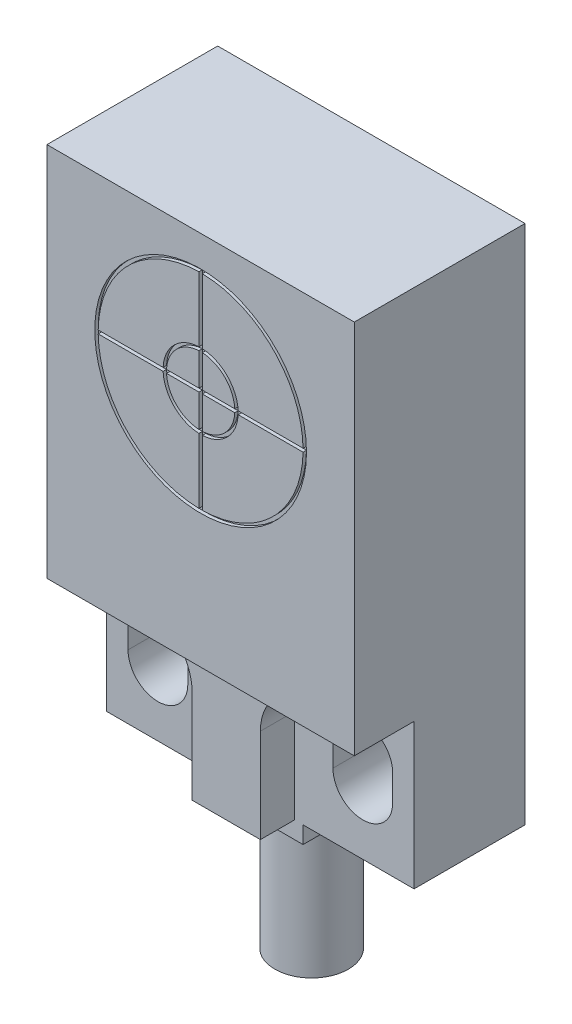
ISO-10303-21;
HEADER;
FILE_DESCRIPTION(('STEP AP214'),'2;1');
FILE_NAME('part.step','',(''),(''),'','','');
FILE_SCHEMA(('AUTOMOTIVE_DESIGN { 1 0 10303 214 1 1 1 1 }'));
ENDSEC;
DATA;
#1=APPLICATION_CONTEXT('core data for automotive mechanical design processes');
#2=APPLICATION_PROTOCOL_DEFINITION('international standard','automotive_design',2000,#1);
#3=PRODUCT_CONTEXT('',#1,'mechanical');
#4=PRODUCT('Part','Part','',(#3));
#5=PRODUCT_RELATED_PRODUCT_CATEGORY('part','',(#4));
#6=PRODUCT_DEFINITION_FORMATION('','',#4);
#7=PRODUCT_DEFINITION_CONTEXT('part definition',#1,'design');
#8=PRODUCT_DEFINITION('design','',#6,#7);
#9=PRODUCT_DEFINITION_SHAPE('','',#8);
#10=(LENGTH_UNIT() NAMED_UNIT(*) SI_UNIT(.MILLI.,.METRE.));
#11=(NAMED_UNIT(*) PLANE_ANGLE_UNIT() SI_UNIT($,.RADIAN.));
#12=(NAMED_UNIT(*) SI_UNIT($,.STERADIAN.) SOLID_ANGLE_UNIT());
#13=UNCERTAINTY_MEASURE_WITH_UNIT(LENGTH_MEASURE(1.E-05),#10,'distance_accuracy_value','');
#14=(GEOMETRIC_REPRESENTATION_CONTEXT(3) GLOBAL_UNCERTAINTY_ASSIGNED_CONTEXT((#13)) GLOBAL_UNIT_ASSIGNED_CONTEXT((#10,
#11,#12)) REPRESENTATION_CONTEXT('',''));
#15=CARTESIAN_POINT('',(0.,0.,0.));
#16=DIRECTION('',(0.,0.,1.));
#17=DIRECTION('',(1.,0.,0.));
#18=AXIS2_PLACEMENT_3D('',#15,#16,#17);
#19=CARTESIAN_POINT('',(9.,22.5,9.8));
#20=DIRECTION('',(0.,0.,1.));
#21=DIRECTION('',(1.,0.,0.));
#22=AXIS2_PLACEMENT_3D('',#19,#20,#21);
#23=CYLINDRICAL_SURFACE('',#22,6.);
#24=CARTESIAN_POINT('',(9.,22.5,9.8));
#25=DIRECTION('',(0.,0.,1.));
#26=DIRECTION('',(1.,0.,0.));
#27=AXIS2_PLACEMENT_3D('',#24,#25,#26);
#28=CIRCLE('',#27,6.);
#29=CARTESIAN_POINT('',(9.1,16.5008333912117,9.8));
#30=VERTEX_POINT('',#29);
#31=CARTESIAN_POINT('',(14.9991666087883,22.4,9.8));
#32=VERTEX_POINT('',#31);
#33=EDGE_CURVE('E522',#30,#32,#28,.T.);
#34=ORIENTED_EDGE('',*,*,#33,.T.);
#35=DIRECTION('',(0.,0.,1.));
#36=VECTOR('',#35,1.);
#37=CARTESIAN_POINT('',(14.9991666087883,22.4,9.8));
#38=LINE('',#37,#36);
#39=CARTESIAN_POINT('',(14.9991666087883,22.4,10.));
#40=VERTEX_POINT('',#39);
#41=EDGE_CURVE('E493',#32,#40,#38,.T.);
#42=ORIENTED_EDGE('',*,*,#41,.T.);
#43=CARTESIAN_POINT('',(9.,22.5,10.));
#44=DIRECTION('',(0.,0.,1.));
#45=DIRECTION('',(1.,0.,0.));
#46=AXIS2_PLACEMENT_3D('',#43,#44,#45);
#47=CIRCLE('',#46,6.);
#48=CARTESIAN_POINT('',(9.1,16.5008333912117,10.));
#49=VERTEX_POINT('',#48);
#50=EDGE_CURVE('E515',#49,#40,#47,.T.);
#51=ORIENTED_EDGE('',*,*,#50,.F.);
#52=DIRECTION('',(0.,0.,1.));
#53=VECTOR('',#52,1.);
#54=CARTESIAN_POINT('',(9.1,16.5008333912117,9.8));
#55=LINE('',#54,#53);
#56=EDGE_CURVE('E470',#49,#30,#55,.F.);
#57=ORIENTED_EDGE('',*,*,#56,.T.);
#58=EDGE_LOOP('',(#34,#42,#51,#57));
#59=FACE_BOUND('',#58,.T.);
#60=ADVANCED_FACE('F65',(#59),#23,.T.);
#61=DIRECTION('',(0.,0.,1.));
#62=VECTOR('',#61,1.);
#63=CARTESIAN_POINT('',(14.9991666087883,22.6,9.8));
#64=LINE('',#63,#62);
#65=CARTESIAN_POINT('',(14.9991666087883,22.6,9.8));
#66=VERTEX_POINT('',#65);
#67=CARTESIAN_POINT('',(14.9991666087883,22.6,10.));
#68=VERTEX_POINT('',#67);
#69=EDGE_CURVE('E501',#66,#68,#64,.T.);
#70=ORIENTED_EDGE('',*,*,#69,.F.);
#71=CARTESIAN_POINT('',(9.1,28.4991666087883,9.8));
#72=VERTEX_POINT('',#71);
#73=EDGE_CURVE('E527',#66,#72,#28,.T.);
#74=ORIENTED_EDGE('',*,*,#73,.T.);
#75=DIRECTION('',(0.,0.,1.));
#76=VECTOR('',#75,1.);
#77=CARTESIAN_POINT('',(9.1,28.4991666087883,9.8));
#78=LINE('',#77,#76);
#79=CARTESIAN_POINT('',(9.1,28.4991666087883,10.));
#80=VERTEX_POINT('',#79);
#81=EDGE_CURVE('E449',#72,#80,#78,.T.);
#82=ORIENTED_EDGE('',*,*,#81,.T.);
#83=EDGE_CURVE('E526',#68,#80,#47,.T.);
#84=ORIENTED_EDGE('',*,*,#83,.F.);
#85=EDGE_LOOP('',(#70,#74,#82,#84));
#86=FACE_BOUND('',#85,.T.);
#87=ADVANCED_FACE('F884',(#86),#23,.T.);
#88=CARTESIAN_POINT('',(3.00083339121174,22.4,10.));
#89=VERTEX_POINT('',#88);
#90=CARTESIAN_POINT('',(8.9,16.5008333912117,10.));
#91=VERTEX_POINT('',#90);
#92=EDGE_CURVE('E530',#89,#91,#47,.T.);
#93=ORIENTED_EDGE('',*,*,#92,.F.);
#94=DIRECTION('',(0.,0.,1.));
#95=VECTOR('',#94,1.);
#96=CARTESIAN_POINT('',(3.00083339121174,22.4,9.8));
#97=LINE('',#96,#95);
#98=CARTESIAN_POINT('',(3.00083339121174,22.4,9.8));
#99=VERTEX_POINT('',#98);
#100=EDGE_CURVE('E478',#89,#99,#97,.F.);
#101=ORIENTED_EDGE('',*,*,#100,.T.);
#102=CARTESIAN_POINT('',(8.9,16.5008333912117,9.8));
#103=VERTEX_POINT('',#102);
#104=EDGE_CURVE('E525',#99,#103,#28,.T.);
#105=ORIENTED_EDGE('',*,*,#104,.T.);
#106=DIRECTION('',(0.,0.,1.));
#107=VECTOR('',#106,1.);
#108=CARTESIAN_POINT('',(8.9,16.5008333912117,9.8));
#109=LINE('',#108,#107);
#110=EDGE_CURVE('E463',#91,#103,#109,.F.);
#111=ORIENTED_EDGE('',*,*,#110,.F.);
#112=EDGE_LOOP('',(#93,#101,#105,#111));
#113=FACE_BOUND('',#112,.T.);
#114=ADVANCED_FACE('F891',(#113),#23,.T.);
#115=DIRECTION('',(0.,0.,1.));
#116=VECTOR('',#115,1.);
#117=CARTESIAN_POINT('',(3.00083339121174,22.6,9.8));
#118=LINE('',#117,#116);
#119=CARTESIAN_POINT('',(3.00083339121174,22.6,10.));
#120=VERTEX_POINT('',#119);
#121=CARTESIAN_POINT('',(3.00083339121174,22.6,9.8));
#122=VERTEX_POINT('',#121);
#123=EDGE_CURVE('E486',#120,#122,#118,.F.);
#124=ORIENTED_EDGE('',*,*,#123,.F.);
#125=CARTESIAN_POINT('',(8.9,28.4991666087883,10.));
#126=VERTEX_POINT('',#125);
#127=EDGE_CURVE('E910',#126,#120,#47,.T.);
#128=ORIENTED_EDGE('',*,*,#127,.F.);
#129=DIRECTION('',(0.,0.,1.));
#130=VECTOR('',#129,1.);
#131=CARTESIAN_POINT('',(8.9,28.4991666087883,9.8));
#132=LINE('',#131,#130);
#133=CARTESIAN_POINT('',(8.9,28.4991666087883,9.8));
#134=VERTEX_POINT('',#133);
#135=EDGE_CURVE('E457',#134,#126,#132,.T.);
#136=ORIENTED_EDGE('',*,*,#135,.F.);
#137=EDGE_CURVE('E912',#134,#122,#28,.T.);
#138=ORIENTED_EDGE('',*,*,#137,.T.);
#139=EDGE_LOOP('',(#124,#128,#136,#138));
#140=FACE_BOUND('',#139,.T.);
#141=ADVANCED_FACE('F887',(#140),#23,.T.);
#142=CARTESIAN_POINT('',(0.,0.,10.));
#143=DIRECTION('',(0.,0.,-1.));
#144=DIRECTION('',(-1.,0.,0.));
#145=AXIS2_PLACEMENT_3D('',#142,#143,#144);
#146=PLANE('',#145);
#147=DIRECTION('',(1.,0.,0.));
#148=VECTOR('',#147,1.);
#149=CARTESIAN_POINT('',(15.,22.4,10.));
#150=LINE('',#149,#148);
#151=CARTESIAN_POINT('',(11.1977260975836,22.4,10.));
#152=VERTEX_POINT('',#151);
#153=EDGE_CURVE('E441',#40,#152,#150,.F.);
#154=ORIENTED_EDGE('',*,*,#153,.T.);
#155=CARTESIAN_POINT('',(9.,22.5,10.));
#156=DIRECTION('',(0.,0.,1.));
#157=DIRECTION('',(1.,0.,0.));
#158=AXIS2_PLACEMENT_3D('',#155,#156,#157);
#159=CIRCLE('',#158,2.2);
#160=CARTESIAN_POINT('',(9.1,20.3022739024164,10.));
#161=VERTEX_POINT('',#160);
#162=EDGE_CURVE('E505',#161,#152,#159,.T.);
#163=ORIENTED_EDGE('',*,*,#162,.F.);
#164=DIRECTION('',(0.,1.,0.));
#165=VECTOR('',#164,1.);
#166=CARTESIAN_POINT('',(9.1,28.5,10.));
#167=LINE('',#166,#165);
#168=EDGE_CURVE('E802',#161,#49,#167,.F.);
#169=ORIENTED_EDGE('',*,*,#168,.T.);
#170=ORIENTED_EDGE('',*,*,#50,.T.);
#171=EDGE_LOOP('',(#154,#163,#169,#170));
#172=FACE_BOUND('',#171,.T.);
#173=ADVANCED_FACE('F896',(#172),#146,.F.);
#174=CARTESIAN_POINT('',(6.80227390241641,22.4,10.));
#175=VERTEX_POINT('',#174);
#176=EDGE_CURVE('E439',#175,#89,#150,.F.);
#177=ORIENTED_EDGE('',*,*,#176,.T.);
#178=ORIENTED_EDGE('',*,*,#92,.T.);
#179=DIRECTION('',(0.,1.,0.));
#180=VECTOR('',#179,1.);
#181=CARTESIAN_POINT('',(8.9,28.5,10.));
#182=LINE('',#181,#180);
#183=CARTESIAN_POINT('',(8.9,20.3022739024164,10.));
#184=VERTEX_POINT('',#183);
#185=EDGE_CURVE('E811',#184,#91,#182,.F.);
#186=ORIENTED_EDGE('',*,*,#185,.F.);
#187=EDGE_CURVE('E1008',#175,#184,#159,.T.);
#188=ORIENTED_EDGE('',*,*,#187,.F.);
#189=EDGE_LOOP('',(#177,#178,#186,#188));
#190=FACE_BOUND('',#189,.T.);
#191=ADVANCED_FACE('F902',(#190),#146,.F.);
#192=CARTESIAN_POINT('',(11.1977260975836,22.6,10.));
#193=VERTEX_POINT('',#192);
#194=CARTESIAN_POINT('',(9.1,24.6977260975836,10.));
#195=VERTEX_POINT('',#194);
#196=EDGE_CURVE('E518',#193,#195,#159,.T.);
#197=ORIENTED_EDGE('',*,*,#196,.F.);
#198=DIRECTION('',(1.,0.,0.));
#199=VECTOR('',#198,1.);
#200=CARTESIAN_POINT('',(15.,22.6,10.));
#201=LINE('',#200,#199);
#202=EDGE_CURVE('E437',#68,#193,#201,.F.);
#203=ORIENTED_EDGE('',*,*,#202,.F.);
#204=ORIENTED_EDGE('',*,*,#83,.T.);
#205=EDGE_CURVE('E801',#80,#195,#167,.F.);
#206=ORIENTED_EDGE('',*,*,#205,.T.);
#207=EDGE_LOOP('',(#197,#203,#204,#206));
#208=FACE_BOUND('',#207,.T.);
#209=ADVANCED_FACE('F798',(#208),#146,.F.);
#210=CARTESIAN_POINT('',(9.,22.5,9.8));
#211=DIRECTION('',(0.,0.,1.));
#212=DIRECTION('',(1.,0.,0.));
#213=AXIS2_PLACEMENT_3D('',#210,#211,#212);
#214=CYLINDRICAL_SURFACE('',#213,2.2);
#215=DIRECTION('',(0.,0.,1.));
#216=VECTOR('',#215,1.);
#217=CARTESIAN_POINT('',(11.1977260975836,22.4,9.8));
#218=LINE('',#217,#216);
#219=CARTESIAN_POINT('',(11.1977260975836,22.4,9.8));
#220=VERTEX_POINT('',#219);
#221=EDGE_CURVE('E491',#220,#152,#218,.T.);
#222=ORIENTED_EDGE('',*,*,#221,.F.);
#223=CARTESIAN_POINT('',(9.,22.5,9.8));
#224=DIRECTION('',(0.,0.,1.));
#225=DIRECTION('',(1.,0.,0.));
#226=AXIS2_PLACEMENT_3D('',#223,#224,#225);
#227=CIRCLE('',#226,2.2);
#228=CARTESIAN_POINT('',(9.1,20.3022739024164,9.8));
#229=VERTEX_POINT('',#228);
#230=EDGE_CURVE('E517',#229,#220,#227,.T.);
#231=ORIENTED_EDGE('',*,*,#230,.F.);
#232=DIRECTION('',(0.,0.,1.));
#233=VECTOR('',#232,1.);
#234=CARTESIAN_POINT('',(9.1,20.3022739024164,9.8));
#235=LINE('',#234,#233);
#236=EDGE_CURVE('E468',#161,#229,#235,.F.);
#237=ORIENTED_EDGE('',*,*,#236,.F.);
#238=ORIENTED_EDGE('',*,*,#162,.T.);
#239=EDGE_LOOP('',(#222,#231,#237,#238));
#240=FACE_BOUND('',#239,.T.);
#241=ADVANCED_FACE('F942',(#240),#214,.F.);
#242=DIRECTION('',(0.,0.,1.));
#243=VECTOR('',#242,1.);
#244=CARTESIAN_POINT('',(6.80227390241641,22.4,9.8));
#245=LINE('',#244,#243);
#246=CARTESIAN_POINT('',(6.80227390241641,22.4,9.8));
#247=VERTEX_POINT('',#246);
#248=EDGE_CURVE('E476',#175,#247,#245,.F.);
#249=ORIENTED_EDGE('',*,*,#248,.F.);
#250=ORIENTED_EDGE('',*,*,#187,.T.);
#251=DIRECTION('',(0.,0.,1.));
#252=VECTOR('',#251,1.);
#253=CARTESIAN_POINT('',(8.9,20.3022739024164,9.8));
#254=LINE('',#253,#252);
#255=CARTESIAN_POINT('',(8.9,20.3022739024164,9.8));
#256=VERTEX_POINT('',#255);
#257=EDGE_CURVE('E461',#184,#256,#254,.F.);
#258=ORIENTED_EDGE('',*,*,#257,.T.);
#259=EDGE_CURVE('E929',#247,#256,#227,.T.);
#260=ORIENTED_EDGE('',*,*,#259,.F.);
#261=EDGE_LOOP('',(#249,#250,#258,#260));
#262=FACE_BOUND('',#261,.T.);
#263=ADVANCED_FACE('F999',(#262),#214,.F.);
#264=CARTESIAN_POINT('',(11.1977260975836,22.6,9.8));
#265=VERTEX_POINT('',#264);
#266=CARTESIAN_POINT('',(9.1,24.6977260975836,9.8));
#267=VERTEX_POINT('',#266);
#268=EDGE_CURVE('E512',#265,#267,#227,.T.);
#269=ORIENTED_EDGE('',*,*,#268,.F.);
#270=DIRECTION('',(0.,0.,1.));
#271=VECTOR('',#270,1.);
#272=CARTESIAN_POINT('',(11.1977260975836,22.6,9.8));
#273=LINE('',#272,#271);
#274=EDGE_CURVE('E498',#265,#193,#273,.T.);
#275=ORIENTED_EDGE('',*,*,#274,.T.);
#276=ORIENTED_EDGE('',*,*,#196,.T.);
#277=DIRECTION('',(0.,0.,1.));
#278=VECTOR('',#277,1.);
#279=CARTESIAN_POINT('',(9.1,24.6977260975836,9.8));
#280=LINE('',#279,#278);
#281=EDGE_CURVE('E447',#267,#195,#280,.T.);
#282=ORIENTED_EDGE('',*,*,#281,.F.);
#283=EDGE_LOOP('',(#269,#275,#276,#282));
#284=FACE_BOUND('',#283,.T.);
#285=ADVANCED_FACE('F789',(#284),#214,.F.);
#286=CARTESIAN_POINT('',(9.,22.5,9.8));
#287=DIRECTION('',(0.,0.,1.));
#288=DIRECTION('',(1.,0.,0.));
#289=AXIS2_PLACEMENT_3D('',#286,#287,#288);
#290=CYLINDRICAL_SURFACE('',#289,2.);
#291=CARTESIAN_POINT('',(9.,22.5,9.8));
#292=DIRECTION('',(0.,0.,1.));
#293=DIRECTION('',(1.,0.,0.));
#294=AXIS2_PLACEMENT_3D('',#291,#292,#293);
#295=CIRCLE('',#294,2.);
#296=CARTESIAN_POINT('',(9.1,20.5025015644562,9.8));
#297=VERTEX_POINT('',#296);
#298=CARTESIAN_POINT('',(10.9974984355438,22.4,9.8));
#299=VERTEX_POINT('',#298);
#300=EDGE_CURVE('E507',#297,#299,#295,.T.);
#301=ORIENTED_EDGE('',*,*,#300,.T.);
#302=DIRECTION('',(0.,0.,1.));
#303=VECTOR('',#302,1.);
#304=CARTESIAN_POINT('',(10.9974984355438,22.4,9.8));
#305=LINE('',#304,#303);
#306=CARTESIAN_POINT('',(10.9974984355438,22.4,10.));
#307=VERTEX_POINT('',#306);
#308=EDGE_CURVE('E488',#299,#307,#305,.T.);
#309=ORIENTED_EDGE('',*,*,#308,.T.);
#310=CARTESIAN_POINT('',(9.,22.5,10.));
#311=DIRECTION('',(0.,0.,1.));
#312=DIRECTION('',(1.,0.,0.));
#313=AXIS2_PLACEMENT_3D('',#310,#311,#312);
#314=CIRCLE('',#313,2.);
#315=CARTESIAN_POINT('',(9.1,20.5025015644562,10.));
#316=VERTEX_POINT('',#315);
#317=EDGE_CURVE('E503',#316,#307,#314,.T.);
#318=ORIENTED_EDGE('',*,*,#317,.F.);
#319=DIRECTION('',(0.,0.,1.));
#320=VECTOR('',#319,1.);
#321=CARTESIAN_POINT('',(9.1,20.5025015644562,9.8));
#322=LINE('',#321,#320);
#323=EDGE_CURVE('E465',#316,#297,#322,.F.);
#324=ORIENTED_EDGE('',*,*,#323,.T.);
#325=EDGE_LOOP('',(#301,#309,#318,#324));
#326=FACE_BOUND('',#325,.T.);
#327=ADVANCED_FACE('F767',(#326),#290,.T.);
#328=CARTESIAN_POINT('',(7.00250156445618,22.4,10.));
#329=VERTEX_POINT('',#328);
#330=CARTESIAN_POINT('',(8.9,20.5025015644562,10.));
#331=VERTEX_POINT('',#330);
#332=EDGE_CURVE('E751',#329,#331,#314,.T.);
#333=ORIENTED_EDGE('',*,*,#332,.F.);
#334=DIRECTION('',(0.,0.,1.));
#335=VECTOR('',#334,1.);
#336=CARTESIAN_POINT('',(7.00250156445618,22.4,9.8));
#337=LINE('',#336,#335);
#338=CARTESIAN_POINT('',(7.00250156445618,22.4,9.8));
#339=VERTEX_POINT('',#338);
#340=EDGE_CURVE('E473',#329,#339,#337,.F.);
#341=ORIENTED_EDGE('',*,*,#340,.T.);
#342=CARTESIAN_POINT('',(8.9,20.5025015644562,9.8));
#343=VERTEX_POINT('',#342);
#344=EDGE_CURVE('E1018',#339,#343,#295,.T.);
#345=ORIENTED_EDGE('',*,*,#344,.T.);
#346=DIRECTION('',(0.,0.,1.));
#347=VECTOR('',#346,1.);
#348=CARTESIAN_POINT('',(8.9,20.5025015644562,9.8));
#349=LINE('',#348,#347);
#350=EDGE_CURVE('E459',#331,#343,#349,.F.);
#351=ORIENTED_EDGE('',*,*,#350,.F.);
#352=EDGE_LOOP('',(#333,#341,#345,#351));
#353=FACE_BOUND('',#352,.T.);
#354=ADVANCED_FACE('F1005',(#353),#290,.T.);
#355=DIRECTION('',(0.,0.,1.));
#356=VECTOR('',#355,1.);
#357=CARTESIAN_POINT('',(10.9974984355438,22.6,9.8));
#358=LINE('',#357,#356);
#359=CARTESIAN_POINT('',(10.9974984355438,22.6,9.8));
#360=VERTEX_POINT('',#359);
#361=CARTESIAN_POINT('',(10.9974984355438,22.6,10.));
#362=VERTEX_POINT('',#361);
#363=EDGE_CURVE('E496',#360,#362,#358,.T.);
#364=ORIENTED_EDGE('',*,*,#363,.F.);
#365=CARTESIAN_POINT('',(9.1,24.4974984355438,9.8));
#366=VERTEX_POINT('',#365);
#367=EDGE_CURVE('E400',#360,#366,#295,.T.);
#368=ORIENTED_EDGE('',*,*,#367,.T.);
#369=DIRECTION('',(0.,0.,1.));
#370=VECTOR('',#369,1.);
#371=CARTESIAN_POINT('',(9.1,24.4974984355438,9.8));
#372=LINE('',#371,#370);
#373=CARTESIAN_POINT('',(9.1,24.4974984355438,10.));
#374=VERTEX_POINT('',#373);
#375=EDGE_CURVE('E412',#366,#374,#372,.T.);
#376=ORIENTED_EDGE('',*,*,#375,.T.);
#377=EDGE_CURVE('E508',#362,#374,#314,.T.);
#378=ORIENTED_EDGE('',*,*,#377,.F.);
#379=EDGE_LOOP('',(#364,#368,#376,#378));
#380=FACE_BOUND('',#379,.T.);
#381=ADVANCED_FACE('F990',(#380),#290,.T.);
#382=DIRECTION('',(1.,0.,0.));
#383=VECTOR('',#382,1.);
#384=CARTESIAN_POINT('',(0.,22.4,10.));
#385=LINE('',#384,#383);
#386=CARTESIAN_POINT('',(9.1,22.4,10.));
#387=VERTEX_POINT('',#386);
#388=EDGE_CURVE('E12',#387,#307,#385,.T.);
#389=ORIENTED_EDGE('',*,*,#388,.F.);
#390=EDGE_CURVE('E764',#387,#316,#167,.F.);
#391=ORIENTED_EDGE('',*,*,#390,.T.);
#392=ORIENTED_EDGE('',*,*,#317,.T.);
#393=EDGE_LOOP('',(#389,#391,#392));
#394=FACE_BOUND('',#393,.T.);
#395=ADVANCED_FACE('F762',(#394),#146,.F.);
#396=CARTESIAN_POINT('',(8.9,22.4,10.));
#397=VERTEX_POINT('',#396);
#398=EDGE_CURVE('E445',#397,#329,#150,.F.);
#399=ORIENTED_EDGE('',*,*,#398,.T.);
#400=ORIENTED_EDGE('',*,*,#332,.T.);
#401=EDGE_CURVE('E810',#397,#331,#182,.F.);
#402=ORIENTED_EDGE('',*,*,#401,.F.);
#403=EDGE_LOOP('',(#399,#400,#402));
#404=FACE_BOUND('',#403,.T.);
#405=ADVANCED_FACE('F1410',(#404),#146,.F.);
#406=CARTESIAN_POINT('',(8.9,24.4974984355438,10.));
#407=VERTEX_POINT('',#406);
#408=CARTESIAN_POINT('',(7.00250156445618,22.6,10.));
#409=VERTEX_POINT('',#408);
#410=EDGE_CURVE('E511',#407,#409,#314,.T.);
#411=ORIENTED_EDGE('',*,*,#410,.T.);
#412=CARTESIAN_POINT('',(8.9,22.6,10.));
#413=VERTEX_POINT('',#412);
#414=EDGE_CURVE('E440',#413,#409,#201,.F.);
#415=ORIENTED_EDGE('',*,*,#414,.F.);
#416=DIRECTION('',(0.,1.,0.));
#417=VECTOR('',#416,1.);
#418=CARTESIAN_POINT('',(8.9,0.,10.));
#419=LINE('',#418,#417);
#420=EDGE_CURVE('E73',#413,#407,#419,.T.);
#421=ORIENTED_EDGE('',*,*,#420,.T.);
#422=EDGE_LOOP('',(#411,#415,#421));
#423=FACE_BOUND('',#422,.T.);
#424=ADVANCED_FACE('F742',(#423),#146,.F.);
#425=CARTESIAN_POINT('',(18.,0.,10.));
#426=DIRECTION('',(0.,-1.,0.));
#427=DIRECTION('',(0.,0.,-1.));
#428=AXIS2_PLACEMENT_3D('',#425,#426,#427);
#429=PLANE('',#428);
#430=DIRECTION('',(-1.,0.,0.));
#431=VECTOR('',#430,1.);
#432=CARTESIAN_POINT('',(9.,0.,6.5));
#433=LINE('',#432,#431);
#434=CARTESIAN_POINT('',(11.,0.,6.5));
#435=VERTEX_POINT('',#434);
#436=CARTESIAN_POINT('',(7.,0.,6.5));
#437=VERTEX_POINT('',#436);
#438=EDGE_CURVE('E560',#435,#437,#433,.T.);
#439=ORIENTED_EDGE('',*,*,#438,.F.);
#440=DIRECTION('',(0.,0.,1.));
#441=VECTOR('',#440,1.);
#442=CARTESIAN_POINT('',(11.,0.,6.5));
#443=LINE('',#442,#441);
#444=CARTESIAN_POINT('',(11.,0.,8.5));
#445=VERTEX_POINT('',#444);
#446=EDGE_CURVE('E696',#435,#445,#443,.T.);
#447=ORIENTED_EDGE('',*,*,#446,.T.);
#448=DIRECTION('',(1.,0.,0.));
#449=VECTOR('',#448,1.);
#450=CARTESIAN_POINT('',(7.,0.,8.5));
#451=LINE('',#450,#449);
#452=CARTESIAN_POINT('',(7.,0.,8.5));
#453=VERTEX_POINT('',#452);
#454=EDGE_CURVE('E642',#453,#445,#451,.T.);
#455=ORIENTED_EDGE('',*,*,#454,.F.);
#456=DIRECTION('',(0.,0.,1.));
#457=VECTOR('',#456,1.);
#458=CARTESIAN_POINT('',(7.,0.,6.5));
#459=LINE('',#458,#457);
#460=EDGE_CURVE('E675',#437,#453,#459,.T.);
#461=ORIENTED_EDGE('',*,*,#460,.F.);
#462=EDGE_LOOP('',(#439,#447,#455,#461));
#463=FACE_BOUND('',#462,.T.);
#464=ADVANCED_FACE('F1420',(#463),#429,.T.);
#465=CARTESIAN_POINT('',(0.,0.,0.));
#466=DIRECTION('',(0.,0.,-1.));
#467=DIRECTION('',(-1.,0.,0.));
#468=AXIS2_PLACEMENT_3D('',#465,#466,#467);
#469=PLANE('',#468);
#470=CARTESIAN_POINT('',(3.,5.25,0.));
#471=DIRECTION('',(0.,0.,1.));
#472=DIRECTION('',(1.,0.,0.));
#473=AXIS2_PLACEMENT_3D('',#470,#471,#472);
#474=CIRCLE('',#473,1.75);
#475=CARTESIAN_POINT('',(4.75,5.25,0.));
#476=VERTEX_POINT('',#475);
#477=CARTESIAN_POINT('',(1.25,5.25,0.));
#478=VERTEX_POINT('',#477);
#479=EDGE_CURVE('E577',#476,#478,#474,.T.);
#480=ORIENTED_EDGE('',*,*,#479,.T.);
#481=DIRECTION('',(0.,-1.,0.));
#482=VECTOR('',#481,1.);
#483=CARTESIAN_POINT('',(1.25,5.25,0.));
#484=LINE('',#483,#482);
#485=CARTESIAN_POINT('',(1.25,3.75,0.));
#486=VERTEX_POINT('',#485);
#487=EDGE_CURVE('E580',#478,#486,#484,.T.);
#488=ORIENTED_EDGE('',*,*,#487,.T.);
#489=CARTESIAN_POINT('',(3.,3.75,0.));
#490=DIRECTION('',(0.,0.,1.));
#491=DIRECTION('',(1.,0.,0.));
#492=AXIS2_PLACEMENT_3D('',#489,#490,#491);
#493=CIRCLE('',#492,1.75);
#494=CARTESIAN_POINT('',(4.75,3.75,0.));
#495=VERTEX_POINT('',#494);
#496=EDGE_CURVE('E584',#486,#495,#493,.T.);
#497=ORIENTED_EDGE('',*,*,#496,.T.);
#498=DIRECTION('',(0.,1.,0.));
#499=VECTOR('',#498,1.);
#500=CARTESIAN_POINT('',(4.75,5.25,0.));
#501=LINE('',#500,#499);
#502=EDGE_CURVE('E587',#495,#476,#501,.T.);
#503=ORIENTED_EDGE('',*,*,#502,.T.);
#504=EDGE_LOOP('',(#480,#488,#497,#503));
#505=FACE_BOUND('',#504,.T.);
#506=DIRECTION('',(0.,1.,0.));
#507=VECTOR('',#506,1.);
#508=CARTESIAN_POINT('',(0.,0.,0.));
#509=LINE('',#508,#507);
#510=CARTESIAN_POINT('',(0.,0.,0.));
#511=VERTEX_POINT('',#510);
#512=CARTESIAN_POINT('',(0.,30.5,0.));
#513=VERTEX_POINT('',#512);
#514=EDGE_CURVE('E699',#511,#513,#509,.T.);
#515=ORIENTED_EDGE('',*,*,#514,.T.);
#516=DIRECTION('',(1.,0.,0.));
#517=VECTOR('',#516,1.);
#518=CARTESIAN_POINT('',(0.,30.5,0.));
#519=LINE('',#518,#517);
#520=CARTESIAN_POINT('',(18.,30.5,0.));
#521=VERTEX_POINT('',#520);
#522=EDGE_CURVE('E719',#513,#521,#519,.T.);
#523=ORIENTED_EDGE('',*,*,#522,.T.);
#524=DIRECTION('',(0.,-1.,0.));
#525=VECTOR('',#524,1.);
#526=CARTESIAN_POINT('',(18.,30.5,0.));
#527=LINE('',#526,#525);
#528=CARTESIAN_POINT('',(18.,0.,0.));
#529=VERTEX_POINT('',#528);
#530=EDGE_CURVE('E722',#521,#529,#527,.T.);
#531=ORIENTED_EDGE('',*,*,#530,.T.);
#532=DIRECTION('',(-1.,0.,0.));
#533=VECTOR('',#532,1.);
#534=CARTESIAN_POINT('',(18.,0.,0.));
#535=LINE('',#534,#533);
#536=EDGE_CURVE('E710',#529,#511,#535,.T.);
#537=ORIENTED_EDGE('',*,*,#536,.T.);
#538=EDGE_LOOP('',(#515,#523,#531,#537));
#539=FACE_BOUND('',#538,.T.);
#540=CARTESIAN_POINT('',(15.,3.75,0.));
#541=DIRECTION('',(0.,0.,1.));
#542=DIRECTION('',(1.,0.,0.));
#543=AXIS2_PLACEMENT_3D('',#540,#541,#542);
#544=CIRCLE('',#543,1.75);
#545=CARTESIAN_POINT('',(13.25,3.75,0.));
#546=VERTEX_POINT('',#545);
#547=CARTESIAN_POINT('',(16.75,3.75,0.));
#548=VERTEX_POINT('',#547);
#549=EDGE_CURVE('E611',#546,#548,#544,.T.);
#550=ORIENTED_EDGE('',*,*,#549,.T.);
#551=DIRECTION('',(0.,-1.,0.));
#552=VECTOR('',#551,1.);
#553=CARTESIAN_POINT('',(16.75,5.25,0.));
#554=LINE('',#553,#552);
#555=CARTESIAN_POINT('',(16.75,5.25,0.));
#556=VERTEX_POINT('',#555);
#557=EDGE_CURVE('E609',#556,#548,#554,.T.);
#558=ORIENTED_EDGE('',*,*,#557,.F.);
#559=CARTESIAN_POINT('',(15.,5.25,0.));
#560=DIRECTION('',(0.,0.,1.));
#561=DIRECTION('',(1.,0.,0.));
#562=AXIS2_PLACEMENT_3D('',#559,#560,#561);
#563=CIRCLE('',#562,1.75);
#564=CARTESIAN_POINT('',(13.25,5.25,0.));
#565=VERTEX_POINT('',#564);
#566=EDGE_CURVE('E618',#556,#565,#563,.T.);
#567=ORIENTED_EDGE('',*,*,#566,.T.);
#568=DIRECTION('',(0.,1.,0.));
#569=VECTOR('',#568,1.);
#570=CARTESIAN_POINT('',(13.25,3.75,0.));
#571=LINE('',#570,#569);
#572=EDGE_CURVE('E615',#546,#565,#571,.T.);
#573=ORIENTED_EDGE('',*,*,#572,.F.);
#574=EDGE_LOOP('',(#550,#558,#567,#573));
#575=FACE_BOUND('',#574,.T.);
#576=ADVANCED_FACE('F850',(#505,#539,#575),#469,.T.);
#577=DIRECTION('',(0.,0.,-1.));
#578=VECTOR('',#577,1.);
#579=CARTESIAN_POINT('',(6.5,0.,0.5));
#580=LINE('',#579,#578);
#581=CARTESIAN_POINT('',(6.5,0.,6.5));
#582=VERTEX_POINT('',#581);
#583=CARTESIAN_POINT('',(6.5,0.,0.5));
#584=VERTEX_POINT('',#583);
#585=EDGE_CURVE('E540',#582,#584,#580,.T.);
#586=ORIENTED_EDGE('',*,*,#585,.F.);
#587=DIRECTION('',(1.,0.,0.));
#588=VECTOR('',#587,1.);
#589=CARTESIAN_POINT('',(7.,0.,6.5));
#590=LINE('',#589,#588);
#591=CARTESIAN_POINT('',(0.,0.,6.5));
#592=VERTEX_POINT('',#591);
#593=EDGE_CURVE('E658',#592,#582,#590,.T.);
#594=ORIENTED_EDGE('',*,*,#593,.F.);
#595=DIRECTION('',(0.,0.,-1.));
#596=VECTOR('',#595,1.);
#597=CARTESIAN_POINT('',(0.,0.,10.));
#598=LINE('',#597,#596);
#599=EDGE_CURVE('E564',#592,#511,#598,.T.);
#600=ORIENTED_EDGE('',*,*,#599,.T.);
#601=ORIENTED_EDGE('',*,*,#536,.F.);
#602=DIRECTION('',(0.,0.,-1.));
#603=VECTOR('',#602,1.);
#604=CARTESIAN_POINT('',(18.,0.,10.));
#605=LINE('',#604,#603);
#606=CARTESIAN_POINT('',(18.,0.,6.5));
#607=VERTEX_POINT('',#606);
#608=EDGE_CURVE('E728',#607,#529,#605,.T.);
#609=ORIENTED_EDGE('',*,*,#608,.F.);
#610=DIRECTION('',(1.,0.,0.));
#611=VECTOR('',#610,1.);
#612=CARTESIAN_POINT('',(11.,0.,6.5));
#613=LINE('',#612,#611);
#614=CARTESIAN_POINT('',(11.5,0.,6.5));
#615=VERTEX_POINT('',#614);
#616=EDGE_CURVE('E680',#615,#607,#613,.T.);
#617=ORIENTED_EDGE('',*,*,#616,.F.);
#618=DIRECTION('',(0.,0.,1.));
#619=VECTOR('',#618,1.);
#620=CARTESIAN_POINT('',(11.5,0.,6.5));
#621=LINE('',#620,#619);
#622=CARTESIAN_POINT('',(11.5,0.,0.5));
#623=VERTEX_POINT('',#622);
#624=EDGE_CURVE('E545',#623,#615,#621,.T.);
#625=ORIENTED_EDGE('',*,*,#624,.F.);
#626=DIRECTION('',(1.,0.,0.));
#627=VECTOR('',#626,1.);
#628=CARTESIAN_POINT('',(11.5,0.,0.5));
#629=LINE('',#628,#627);
#630=EDGE_CURVE('E555',#584,#623,#629,.T.);
#631=ORIENTED_EDGE('',*,*,#630,.F.);
#632=EDGE_LOOP('',(#586,#594,#600,#601,#609,#617,#625,#631));
#633=FACE_BOUND('',#632,.T.);
#634=ADVANCED_FACE('F854',(#633),#429,.T.);
#635=CARTESIAN_POINT('',(11.,0.,6.5));
#636=DIRECTION('',(-1.,0.,0.));
#637=DIRECTION('',(0.,0.,1.));
#638=AXIS2_PLACEMENT_3D('',#635,#636,#637);
#639=PLANE('',#638);
#640=DIRECTION('',(0.,1.,0.));
#641=VECTOR('',#640,1.);
#642=CARTESIAN_POINT('',(11.,0.,8.5));
#643=LINE('',#642,#641);
#644=CARTESIAN_POINT('',(11.,5.49999999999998,8.5));
#645=VERTEX_POINT('',#644);
#646=EDGE_CURVE('E644',#445,#645,#643,.T.);
#647=ORIENTED_EDGE('',*,*,#646,.F.);
#648=ORIENTED_EDGE('',*,*,#446,.F.);
#649=DIRECTION('',(0.,-1.,0.));
#650=VECTOR('',#649,1.);
#651=CARTESIAN_POINT('',(11.,0.,6.5));
#652=LINE('',#651,#650);
#653=CARTESIAN_POINT('',(11.,5.49999999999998,6.5));
#654=VERTEX_POINT('',#653);
#655=EDGE_CURVE('E691',#654,#435,#652,.T.);
#656=ORIENTED_EDGE('',*,*,#655,.F.);
#657=DIRECTION('',(0.,0.,1.));
#658=VECTOR('',#657,1.);
#659=CARTESIAN_POINT('',(11.,5.49999999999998,6.5));
#660=LINE('',#659,#658);
#661=EDGE_CURVE('E700',#654,#645,#660,.T.);
#662=ORIENTED_EDGE('',*,*,#661,.T.);
#663=EDGE_LOOP('',(#647,#648,#656,#662));
#664=FACE_BOUND('',#663,.T.);
#665=ADVANCED_FACE('F1440',(#664),#639,.F.);
#666=CARTESIAN_POINT('',(14.,5.5,6.5));
#667=DIRECTION('',(0.,0.,1.));
#668=DIRECTION('',(1.,0.,0.));
#669=AXIS2_PLACEMENT_3D('',#666,#667,#668);
#670=CYLINDRICAL_SURFACE('',#669,3.);
#671=CARTESIAN_POINT('',(14.,5.5,8.5));
#672=DIRECTION('',(0.,0.,-1.));
#673=DIRECTION('',(1.,0.,0.));
#674=AXIS2_PLACEMENT_3D('',#671,#672,#673);
#675=CIRCLE('',#674,3.);
#676=CARTESIAN_POINT('',(14.,8.5,8.5));
#677=VERTEX_POINT('',#676);
#678=EDGE_CURVE('E646',#645,#677,#675,.T.);
#679=ORIENTED_EDGE('',*,*,#678,.F.);
#680=ORIENTED_EDGE('',*,*,#661,.F.);
#681=CARTESIAN_POINT('',(14.,5.5,6.5));
#682=DIRECTION('',(0.,0.,1.));
#683=DIRECTION('',(-1.,0.,0.));
#684=AXIS2_PLACEMENT_3D('',#681,#682,#683);
#685=CIRCLE('',#684,3.);
#686=CARTESIAN_POINT('',(14.,8.5,6.5));
#687=VERTEX_POINT('',#686);
#688=EDGE_CURVE('E688',#687,#654,#685,.T.);
#689=ORIENTED_EDGE('',*,*,#688,.F.);
#690=DIRECTION('',(0.,0.,1.));
#691=VECTOR('',#690,1.);
#692=CARTESIAN_POINT('',(14.,8.5,6.5));
#693=LINE('',#692,#691);
#694=EDGE_CURVE('E703',#687,#677,#693,.T.);
#695=ORIENTED_EDGE('',*,*,#694,.T.);
#696=EDGE_LOOP('',(#679,#680,#689,#695));
#697=FACE_BOUND('',#696,.T.);
#698=ADVANCED_FACE('F1446',(#697),#670,.F.);
#699=CARTESIAN_POINT('',(4.,5.5,6.5));
#700=DIRECTION('',(0.,0.,1.));
#701=DIRECTION('',(1.,0.,0.));
#702=AXIS2_PLACEMENT_3D('',#699,#700,#701);
#703=CYLINDRICAL_SURFACE('',#702,3.);
#704=CARTESIAN_POINT('',(3.99999999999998,5.5,8.5));
#705=DIRECTION('',(0.,0.,-1.));
#706=DIRECTION('',(1.,0.,0.));
#707=AXIS2_PLACEMENT_3D('',#704,#705,#706);
#708=CIRCLE('',#707,3.00000000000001);
#709=CARTESIAN_POINT('',(3.99999999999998,8.5,8.5));
#710=VERTEX_POINT('',#709);
#711=CARTESIAN_POINT('',(7.,5.49999999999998,8.5));
#712=VERTEX_POINT('',#711);
#713=EDGE_CURVE('E651',#710,#712,#708,.T.);
#714=ORIENTED_EDGE('',*,*,#713,.F.);
#715=DIRECTION('',(0.,0.,1.));
#716=VECTOR('',#715,1.);
#717=CARTESIAN_POINT('',(3.99999999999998,8.5,6.5));
#718=LINE('',#717,#716);
#719=CARTESIAN_POINT('',(3.99999999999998,8.5,6.5));
#720=VERTEX_POINT('',#719);
#721=EDGE_CURVE('E668',#720,#710,#718,.T.);
#722=ORIENTED_EDGE('',*,*,#721,.F.);
#723=CARTESIAN_POINT('',(4.,5.5,6.5));
#724=DIRECTION('',(0.,0.,1.));
#725=DIRECTION('',(1.,0.,0.));
#726=AXIS2_PLACEMENT_3D('',#723,#724,#725);
#727=CIRCLE('',#726,3.);
#728=CARTESIAN_POINT('',(7.,5.49999999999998,6.5));
#729=VERTEX_POINT('',#728);
#730=EDGE_CURVE('E664',#729,#720,#727,.T.);
#731=ORIENTED_EDGE('',*,*,#730,.F.);
#732=DIRECTION('',(0.,0.,1.));
#733=VECTOR('',#732,1.);
#734=CARTESIAN_POINT('',(7.,5.49999999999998,6.5));
#735=LINE('',#734,#733);
#736=EDGE_CURVE('E672',#729,#712,#735,.T.);
#737=ORIENTED_EDGE('',*,*,#736,.T.);
#738=EDGE_LOOP('',(#714,#722,#731,#737));
#739=FACE_BOUND('',#738,.T.);
#740=ADVANCED_FACE('F1452',(#739),#703,.F.);
#741=CARTESIAN_POINT('',(7.,0.,6.5));
#742=DIRECTION('',(1.,0.,0.));
#743=DIRECTION('',(0.,0.,-1.));
#744=AXIS2_PLACEMENT_3D('',#741,#742,#743);
#745=PLANE('',#744);
#746=DIRECTION('',(0.,-1.,0.));
#747=VECTOR('',#746,1.);
#748=CARTESIAN_POINT('',(7.,0.,8.5));
#749=LINE('',#748,#747);
#750=EDGE_CURVE('E640',#712,#453,#749,.T.);
#751=ORIENTED_EDGE('',*,*,#750,.F.);
#752=ORIENTED_EDGE('',*,*,#736,.F.);
#753=DIRECTION('',(0.,1.,0.));
#754=VECTOR('',#753,1.);
#755=CARTESIAN_POINT('',(7.,0.,6.5));
#756=LINE('',#755,#754);
#757=EDGE_CURVE('E661',#437,#729,#756,.T.);
#758=ORIENTED_EDGE('',*,*,#757,.F.);
#759=ORIENTED_EDGE('',*,*,#460,.T.);
#760=EDGE_LOOP('',(#751,#752,#758,#759));
#761=FACE_BOUND('',#760,.T.);
#762=ADVANCED_FACE('F831',(#761),#745,.F.);
#763=CARTESIAN_POINT('',(0.,0.,10.));
#764=DIRECTION('',(-1.,0.,0.));
#765=DIRECTION('',(0.,0.,1.));
#766=AXIS2_PLACEMENT_3D('',#763,#764,#765);
#767=PLANE('',#766);
#768=CARTESIAN_POINT('',(0.,12.5,7.5));
#769=DIRECTION('',(-1.,0.,0.));
#770=DIRECTION('',(0.,0.,1.));
#771=AXIS2_PLACEMENT_3D('',#768,#769,#770);
#772=CIRCLE('',#771,1.3);
#773=CARTESIAN_POINT('',(0.,12.5,8.8));
#774=VERTEX_POINT('',#773);
#775=EDGE_CURVE('E818',#774,#774,#772,.T.);
#776=ORIENTED_EDGE('',*,*,#775,.F.);
#777=EDGE_LOOP('',(#776));
#778=FACE_BOUND('',#777,.T.);
#779=DIRECTION('',(0.,0.,1.));
#780=VECTOR('',#779,1.);
#781=CARTESIAN_POINT('',(0.,8.5,6.5));
#782=LINE('',#781,#780);
#783=CARTESIAN_POINT('',(0.,8.5,6.5));
#784=VERTEX_POINT('',#783);
#785=CARTESIAN_POINT('',(0.,8.5,10.));
#786=VERTEX_POINT('',#785);
#787=EDGE_CURVE('E667',#784,#786,#782,.T.);
#788=ORIENTED_EDGE('',*,*,#787,.T.);
#789=DIRECTION('',(0.,1.,0.));
#790=VECTOR('',#789,1.);
#791=CARTESIAN_POINT('',(0.,0.,10.));
#792=LINE('',#791,#790);
#793=CARTESIAN_POINT('',(0.,30.5,10.));
#794=VERTEX_POINT('',#793);
#795=EDGE_CURVE('E707',#786,#794,#792,.T.);
#796=ORIENTED_EDGE('',*,*,#795,.T.);
#797=DIRECTION('',(0.,0.,-1.));
#798=VECTOR('',#797,1.);
#799=CARTESIAN_POINT('',(0.,30.5,10.));
#800=LINE('',#799,#798);
#801=EDGE_CURVE('E716',#794,#513,#800,.T.);
#802=ORIENTED_EDGE('',*,*,#801,.T.);
#803=ORIENTED_EDGE('',*,*,#514,.F.);
#804=ORIENTED_EDGE('',*,*,#599,.F.);
#805=DIRECTION('',(0.,-1.,0.));
#806=VECTOR('',#805,1.);
#807=CARTESIAN_POINT('',(0.,8.5,6.5));
#808=LINE('',#807,#806);
#809=EDGE_CURVE('E656',#784,#592,#808,.T.);
#810=ORIENTED_EDGE('',*,*,#809,.F.);
#811=EDGE_LOOP('',(#788,#796,#802,#803,#804,#810));
#812=FACE_BOUND('',#811,.T.);
#813=ADVANCED_FACE('F67',(#778,#812),#767,.T.);
#814=CARTESIAN_POINT('',(18.,30.5,10.));
#815=DIRECTION('',(1.,0.,0.));
#816=DIRECTION('',(0.,0.,-1.));
#817=AXIS2_PLACEMENT_3D('',#814,#815,#816);
#818=PLANE('',#817);
#819=DIRECTION('',(0.,0.,1.));
#820=VECTOR('',#819,1.);
#821=CARTESIAN_POINT('',(18.,8.5,6.5));
#822=LINE('',#821,#820);
#823=CARTESIAN_POINT('',(18.,8.5,6.5));
#824=VERTEX_POINT('',#823);
#825=CARTESIAN_POINT('',(18.,8.50000000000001,10.));
#826=VERTEX_POINT('',#825);
#827=EDGE_CURVE('E694',#824,#826,#822,.T.);
#828=ORIENTED_EDGE('',*,*,#827,.F.);
#829=DIRECTION('',(0.,1.,0.));
#830=VECTOR('',#829,1.);
#831=CARTESIAN_POINT('',(18.,0.,6.5));
#832=LINE('',#831,#830);
#833=EDGE_CURVE('E682',#607,#824,#832,.T.);
#834=ORIENTED_EDGE('',*,*,#833,.F.);
#835=ORIENTED_EDGE('',*,*,#608,.T.);
#836=ORIENTED_EDGE('',*,*,#530,.F.);
#837=DIRECTION('',(0.,0.,-1.));
#838=VECTOR('',#837,1.);
#839=CARTESIAN_POINT('',(18.,30.5,10.));
#840=LINE('',#839,#838);
#841=CARTESIAN_POINT('',(18.,30.5,10.));
#842=VERTEX_POINT('',#841);
#843=EDGE_CURVE('E730',#842,#521,#840,.T.);
#844=ORIENTED_EDGE('',*,*,#843,.F.);
#845=DIRECTION('',(0.,-1.,0.));
#846=VECTOR('',#845,1.);
#847=CARTESIAN_POINT('',(18.,30.5,10.));
#848=LINE('',#847,#846);
#849=EDGE_CURVE('E713',#842,#826,#848,.T.);
#850=ORIENTED_EDGE('',*,*,#849,.T.);
#851=EDGE_LOOP('',(#828,#834,#835,#836,#844,#850));
#852=FACE_BOUND('',#851,.T.);
#853=ADVANCED_FACE('F830',(#852),#818,.T.);
#854=CARTESIAN_POINT('',(0.,30.5,10.));
#855=DIRECTION('',(0.,1.,0.));
#856=DIRECTION('',(0.,0.,1.));
#857=AXIS2_PLACEMENT_3D('',#854,#855,#856);
#858=PLANE('',#857);
#859=ORIENTED_EDGE('',*,*,#522,.F.);
#860=ORIENTED_EDGE('',*,*,#801,.F.);
#861=DIRECTION('',(1.,0.,0.));
#862=VECTOR('',#861,1.);
#863=CARTESIAN_POINT('',(0.,30.5,10.));
#864=LINE('',#863,#862);
#865=EDGE_CURVE('E709',#794,#842,#864,.T.);
#866=ORIENTED_EDGE('',*,*,#865,.T.);
#867=ORIENTED_EDGE('',*,*,#843,.T.);
#868=EDGE_LOOP('',(#859,#860,#866,#867));
#869=FACE_BOUND('',#868,.T.);
#870=ADVANCED_FACE('F845',(#869),#858,.T.);
#871=CARTESIAN_POINT('',(9.,22.5,10.));
#872=DIRECTION('',(0.,0.,1.));
#873=DIRECTION('',(1.,0.,0.));
#874=AXIS2_PLACEMENT_3D('',#871,#872,#873);
#875=CIRCLE('',#874,6.2);
#876=CARTESIAN_POINT('',(15.2,22.5,10.));
#877=VERTEX_POINT('',#876);
#878=EDGE_CURVE('E535',#877,#877,#875,.T.);
#879=ORIENTED_EDGE('',*,*,#878,.F.);
#880=EDGE_LOOP('',(#879));
#881=FACE_BOUND('',#880,.T.);
#882=ORIENTED_EDGE('',*,*,#795,.F.);
#883=DIRECTION('',(-1.,0.,0.));
#884=VECTOR('',#883,1.);
#885=CARTESIAN_POINT('',(14.,8.5,10.));
#886=LINE('',#885,#884);
#887=EDGE_CURVE('E671',#826,#786,#886,.T.);
#888=ORIENTED_EDGE('',*,*,#887,.F.);
#889=ORIENTED_EDGE('',*,*,#849,.F.);
#890=ORIENTED_EDGE('',*,*,#865,.F.);
#891=EDGE_LOOP('',(#882,#888,#889,#890));
#892=FACE_BOUND('',#891,.T.);
#893=ADVANCED_FACE('F841',(#881,#892),#146,.F.);
#894=CARTESIAN_POINT('',(14.,8.5,6.5));
#895=DIRECTION('',(0.,1.,0.));
#896=DIRECTION('',(0.,0.,1.));
#897=AXIS2_PLACEMENT_3D('',#894,#895,#896);
#898=PLANE('',#897);
#899=ORIENTED_EDGE('',*,*,#887,.T.);
#900=ORIENTED_EDGE('',*,*,#787,.F.);
#901=DIRECTION('',(-1.,0.,0.));
#902=VECTOR('',#901,1.);
#903=CARTESIAN_POINT('',(0.,8.5,6.5));
#904=LINE('',#903,#902);
#905=EDGE_CURVE('E653',#720,#784,#904,.T.);
#906=ORIENTED_EDGE('',*,*,#905,.F.);
#907=ORIENTED_EDGE('',*,*,#721,.T.);
#908=DIRECTION('',(-1.,0.,0.));
#909=VECTOR('',#908,1.);
#910=CARTESIAN_POINT('',(3.99999999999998,8.5,8.5));
#911=LINE('',#910,#909);
#912=EDGE_CURVE('E649',#677,#710,#911,.T.);
#913=ORIENTED_EDGE('',*,*,#912,.F.);
#914=ORIENTED_EDGE('',*,*,#694,.F.);
#915=DIRECTION('',(-1.,0.,0.));
#916=VECTOR('',#915,1.);
#917=CARTESIAN_POINT('',(14.,8.5,6.5));
#918=LINE('',#917,#916);
#919=EDGE_CURVE('E685',#824,#687,#918,.T.);
#920=ORIENTED_EDGE('',*,*,#919,.F.);
#921=ORIENTED_EDGE('',*,*,#827,.T.);
#922=EDGE_LOOP('',(#899,#900,#906,#907,#913,#914,#920,#921));
#923=FACE_BOUND('',#922,.T.);
#924=ADVANCED_FACE('F1149',(#923),#898,.F.);
#925=CARTESIAN_POINT('',(4.,5.5,6.5));
#926=DIRECTION('',(0.,0.,1.));
#927=DIRECTION('',(1.,0.,0.));
#928=AXIS2_PLACEMENT_3D('',#925,#926,#927);
#929=PLANE('',#928);
#930=CARTESIAN_POINT('',(3.,5.25,6.5));
#931=DIRECTION('',(0.,0.,1.));
#932=DIRECTION('',(1.,0.,0.));
#933=AXIS2_PLACEMENT_3D('',#930,#931,#932);
#934=CIRCLE('',#933,1.75);
#935=CARTESIAN_POINT('',(4.75,5.25,6.5));
#936=VERTEX_POINT('',#935);
#937=CARTESIAN_POINT('',(1.25,5.25,6.5));
#938=VERTEX_POINT('',#937);
#939=EDGE_CURVE('E576',#936,#938,#934,.T.);
#940=ORIENTED_EDGE('',*,*,#939,.F.);
#941=DIRECTION('',(0.,1.,0.));
#942=VECTOR('',#941,1.);
#943=CARTESIAN_POINT('',(4.75,5.25,6.5));
#944=LINE('',#943,#942);
#945=CARTESIAN_POINT('',(4.75,3.75,6.5));
#946=VERTEX_POINT('',#945);
#947=EDGE_CURVE('E581',#946,#936,#944,.T.);
#948=ORIENTED_EDGE('',*,*,#947,.F.);
#949=CARTESIAN_POINT('',(3.,3.75,6.5));
#950=DIRECTION('',(0.,0.,1.));
#951=DIRECTION('',(1.,0.,0.));
#952=AXIS2_PLACEMENT_3D('',#949,#950,#951);
#953=CIRCLE('',#952,1.75);
#954=CARTESIAN_POINT('',(1.25,3.75,6.5));
#955=VERTEX_POINT('',#954);
#956=EDGE_CURVE('E595',#955,#946,#953,.T.);
#957=ORIENTED_EDGE('',*,*,#956,.F.);
#958=DIRECTION('',(0.,-1.,0.));
#959=VECTOR('',#958,1.);
#960=CARTESIAN_POINT('',(1.25,5.25,6.5));
#961=LINE('',#960,#959);
#962=EDGE_CURVE('E592',#938,#955,#961,.T.);
#963=ORIENTED_EDGE('',*,*,#962,.F.);
#964=EDGE_LOOP('',(#940,#948,#957,#963));
#965=FACE_BOUND('',#964,.T.);
#966=ORIENTED_EDGE('',*,*,#905,.T.);
#967=ORIENTED_EDGE('',*,*,#809,.T.);
#968=ORIENTED_EDGE('',*,*,#593,.T.);
#969=DIRECTION('',(0.,1.,0.));
#970=VECTOR('',#969,1.);
#971=CARTESIAN_POINT('',(6.5,-1.,6.5));
#972=LINE('',#971,#970);
#973=CARTESIAN_POINT('',(6.5,-1.,6.5));
#974=VERTEX_POINT('',#973);
#975=EDGE_CURVE('E573',#974,#582,#972,.T.);
#976=ORIENTED_EDGE('',*,*,#975,.F.);
#977=DIRECTION('',(-1.,0.,0.));
#978=VECTOR('',#977,1.);
#979=CARTESIAN_POINT('',(9.,-1.,6.5));
#980=LINE('',#979,#978);
#981=CARTESIAN_POINT('',(11.5,-1.,6.5));
#982=VERTEX_POINT('',#981);
#983=EDGE_CURVE('E541',#982,#974,#980,.T.);
#984=ORIENTED_EDGE('',*,*,#983,.F.);
#985=DIRECTION('',(0.,1.,0.));
#986=VECTOR('',#985,1.);
#987=CARTESIAN_POINT('',(11.5,-1.,6.5));
#988=LINE('',#987,#986);
#989=EDGE_CURVE('E552',#982,#615,#988,.T.);
#990=ORIENTED_EDGE('',*,*,#989,.T.);
#991=ORIENTED_EDGE('',*,*,#616,.T.);
#992=ORIENTED_EDGE('',*,*,#833,.T.);
#993=ORIENTED_EDGE('',*,*,#919,.T.);
#994=ORIENTED_EDGE('',*,*,#688,.T.);
#995=ORIENTED_EDGE('',*,*,#655,.T.);
#996=ORIENTED_EDGE('',*,*,#438,.T.);
#997=ORIENTED_EDGE('',*,*,#757,.T.);
#998=ORIENTED_EDGE('',*,*,#730,.T.);
#999=EDGE_LOOP('',(#966,#967,#968,#976,#984,#990,#991,#992,#993,#994,#995,#996,#997,#998));
#1000=FACE_BOUND('',#999,.T.);
#1001=DIRECTION('',(0.,-1.,0.));
#1002=VECTOR('',#1001,1.);
#1003=CARTESIAN_POINT('',(16.75,5.25,6.5));
#1004=LINE('',#1003,#1002);
#1005=CARTESIAN_POINT('',(16.75,5.25,6.5));
#1006=VERTEX_POINT('',#1005);
#1007=CARTESIAN_POINT('',(16.75,3.75,6.5));
#1008=VERTEX_POINT('',#1007);
#1009=EDGE_CURVE('E602',#1006,#1008,#1004,.T.);
#1010=ORIENTED_EDGE('',*,*,#1009,.T.);
#1011=CARTESIAN_POINT('',(15.,3.75,6.5));
#1012=DIRECTION('',(0.,0.,1.));
#1013=DIRECTION('',(1.,0.,0.));
#1014=AXIS2_PLACEMENT_3D('',#1011,#1012,#1013);
#1015=CIRCLE('',#1014,1.75);
#1016=CARTESIAN_POINT('',(13.25,3.75,6.5));
#1017=VERTEX_POINT('',#1016);
#1018=EDGE_CURVE('E624',#1017,#1008,#1015,.T.);
#1019=ORIENTED_EDGE('',*,*,#1018,.F.);
#1020=DIRECTION('',(0.,1.,0.));
#1021=VECTOR('',#1020,1.);
#1022=CARTESIAN_POINT('',(13.25,3.75,6.5));
#1023=LINE('',#1022,#1021);
#1024=CARTESIAN_POINT('',(13.25,5.25,6.5));
#1025=VERTEX_POINT('',#1024);
#1026=EDGE_CURVE('E627',#1017,#1025,#1023,.T.);
#1027=ORIENTED_EDGE('',*,*,#1026,.T.);
#1028=CARTESIAN_POINT('',(15.,5.25,6.5));
#1029=DIRECTION('',(0.,0.,1.));
#1030=DIRECTION('',(1.,0.,0.));
#1031=AXIS2_PLACEMENT_3D('',#1028,#1029,#1030);
#1032=CIRCLE('',#1031,1.75);
#1033=EDGE_CURVE('E612',#1006,#1025,#1032,.T.);
#1034=ORIENTED_EDGE('',*,*,#1033,.F.);
#1035=EDGE_LOOP('',(#1010,#1019,#1027,#1034));
#1036=FACE_BOUND('',#1035,.T.);
#1037=ADVANCED_FACE('F858',(#965,#1000,#1036),#929,.T.);
#1038=CARTESIAN_POINT('',(3.99999999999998,5.5,8.5));
#1039=DIRECTION('',(0.,0.,1.));
#1040=DIRECTION('',(1.,0.,0.));
#1041=AXIS2_PLACEMENT_3D('',#1038,#1039,#1040);
#1042=PLANE('',#1041);
#1043=ORIENTED_EDGE('',*,*,#750,.T.);
#1044=ORIENTED_EDGE('',*,*,#454,.T.);
#1045=ORIENTED_EDGE('',*,*,#646,.T.);
#1046=ORIENTED_EDGE('',*,*,#678,.T.);
#1047=ORIENTED_EDGE('',*,*,#912,.T.);
#1048=ORIENTED_EDGE('',*,*,#713,.T.);
#1049=EDGE_LOOP('',(#1043,#1044,#1045,#1046,#1047,#1048));
#1050=FACE_BOUND('',#1049,.T.);
#1051=ADVANCED_FACE('F1166',(#1050),#1042,.T.);
#1052=CARTESIAN_POINT('',(16.75,5.25,0.));
#1053=DIRECTION('',(-1.,0.,0.));
#1054=DIRECTION('',(0.,0.,1.));
#1055=AXIS2_PLACEMENT_3D('',#1052,#1053,#1054);
#1056=PLANE('',#1055);
#1057=ORIENTED_EDGE('',*,*,#1009,.F.);
#1058=DIRECTION('',(0.,0.,1.));
#1059=VECTOR('',#1058,1.);
#1060=CARTESIAN_POINT('',(16.75,5.25,0.));
#1061=LINE('',#1060,#1059);
#1062=EDGE_CURVE('E621',#556,#1006,#1061,.T.);
#1063=ORIENTED_EDGE('',*,*,#1062,.F.);
#1064=ORIENTED_EDGE('',*,*,#557,.T.);
#1065=DIRECTION('',(0.,0.,1.));
#1066=VECTOR('',#1065,1.);
#1067=CARTESIAN_POINT('',(16.75,3.75,0.));
#1068=LINE('',#1067,#1066);
#1069=EDGE_CURVE('E638',#548,#1008,#1068,.T.);
#1070=ORIENTED_EDGE('',*,*,#1069,.T.);
#1071=EDGE_LOOP('',(#1057,#1063,#1064,#1070));
#1072=FACE_BOUND('',#1071,.T.);
#1073=ADVANCED_FACE('F1174',(#1072),#1056,.T.);
#1074=CARTESIAN_POINT('',(15.,3.75,0.));
#1075=DIRECTION('',(0.,0.,1.));
#1076=DIRECTION('',(1.,0.,0.));
#1077=AXIS2_PLACEMENT_3D('',#1074,#1075,#1076);
#1078=CYLINDRICAL_SURFACE('',#1077,1.75);
#1079=ORIENTED_EDGE('',*,*,#1018,.T.);
#1080=ORIENTED_EDGE('',*,*,#1069,.F.);
#1081=ORIENTED_EDGE('',*,*,#549,.F.);
#1082=DIRECTION('',(0.,0.,1.));
#1083=VECTOR('',#1082,1.);
#1084=CARTESIAN_POINT('',(13.25,3.75,0.));
#1085=LINE('',#1084,#1083);
#1086=EDGE_CURVE('E636',#546,#1017,#1085,.T.);
#1087=ORIENTED_EDGE('',*,*,#1086,.T.);
#1088=EDGE_LOOP('',(#1079,#1080,#1081,#1087));
#1089=FACE_BOUND('',#1088,.T.);
#1090=ADVANCED_FACE('F1182',(#1089),#1078,.F.);
#1091=CARTESIAN_POINT('',(13.25,3.75,0.));
#1092=DIRECTION('',(1.,0.,0.));
#1093=DIRECTION('',(0.,0.,-1.));
#1094=AXIS2_PLACEMENT_3D('',#1091,#1092,#1093);
#1095=PLANE('',#1094);
#1096=ORIENTED_EDGE('',*,*,#1026,.F.);
#1097=ORIENTED_EDGE('',*,*,#1086,.F.);
#1098=ORIENTED_EDGE('',*,*,#572,.T.);
#1099=DIRECTION('',(0.,0.,1.));
#1100=VECTOR('',#1099,1.);
#1101=CARTESIAN_POINT('',(13.25,5.25,0.));
#1102=LINE('',#1101,#1100);
#1103=EDGE_CURVE('E634',#565,#1025,#1102,.T.);
#1104=ORIENTED_EDGE('',*,*,#1103,.T.);
#1105=EDGE_LOOP('',(#1096,#1097,#1098,#1104));
#1106=FACE_BOUND('',#1105,.T.);
#1107=ADVANCED_FACE('F1190',(#1106),#1095,.T.);
#1108=CARTESIAN_POINT('',(15.,5.25,0.));
#1109=DIRECTION('',(0.,0.,1.));
#1110=DIRECTION('',(1.,0.,0.));
#1111=AXIS2_PLACEMENT_3D('',#1108,#1109,#1110);
#1112=CYLINDRICAL_SURFACE('',#1111,1.75);
#1113=ORIENTED_EDGE('',*,*,#1033,.T.);
#1114=ORIENTED_EDGE('',*,*,#1103,.F.);
#1115=ORIENTED_EDGE('',*,*,#566,.F.);
#1116=ORIENTED_EDGE('',*,*,#1062,.T.);
#1117=EDGE_LOOP('',(#1113,#1114,#1115,#1116));
#1118=FACE_BOUND('',#1117,.T.);
#1119=ADVANCED_FACE('F1198',(#1118),#1112,.F.);
#1120=CARTESIAN_POINT('',(3.,5.25,0.));
#1121=DIRECTION('',(0.,0.,1.));
#1122=DIRECTION('',(1.,0.,0.));
#1123=AXIS2_PLACEMENT_3D('',#1120,#1121,#1122);
#1124=CYLINDRICAL_SURFACE('',#1123,1.75);
#1125=ORIENTED_EDGE('',*,*,#939,.T.);
#1126=DIRECTION('',(0.,0.,1.));
#1127=VECTOR('',#1126,1.);
#1128=CARTESIAN_POINT('',(1.25,5.25,0.));
#1129=LINE('',#1128,#1127);
#1130=EDGE_CURVE('E590',#478,#938,#1129,.T.);
#1131=ORIENTED_EDGE('',*,*,#1130,.F.);
#1132=ORIENTED_EDGE('',*,*,#479,.F.);
#1133=DIRECTION('',(0.,0.,1.));
#1134=VECTOR('',#1133,1.);
#1135=CARTESIAN_POINT('',(4.75,5.25,0.));
#1136=LINE('',#1135,#1134);
#1137=EDGE_CURVE('E600',#476,#936,#1136,.T.);
#1138=ORIENTED_EDGE('',*,*,#1137,.T.);
#1139=EDGE_LOOP('',(#1125,#1131,#1132,#1138));
#1140=FACE_BOUND('',#1139,.T.);
#1141=ADVANCED_FACE('F1206',(#1140),#1124,.F.);
#1142=CARTESIAN_POINT('',(4.75,5.25,0.));
#1143=DIRECTION('',(1.,0.,0.));
#1144=DIRECTION('',(0.,0.,-1.));
#1145=AXIS2_PLACEMENT_3D('',#1142,#1143,#1144);
#1146=PLANE('',#1145);
#1147=ORIENTED_EDGE('',*,*,#947,.T.);
#1148=ORIENTED_EDGE('',*,*,#1137,.F.);
#1149=ORIENTED_EDGE('',*,*,#502,.F.);
#1150=DIRECTION('',(0.,0.,1.));
#1151=VECTOR('',#1150,1.);
#1152=CARTESIAN_POINT('',(4.75,3.75,0.));
#1153=LINE('',#1152,#1151);
#1154=EDGE_CURVE('E603',#495,#946,#1153,.T.);
#1155=ORIENTED_EDGE('',*,*,#1154,.T.);
#1156=EDGE_LOOP('',(#1147,#1148,#1149,#1155));
#1157=FACE_BOUND('',#1156,.T.);
#1158=ADVANCED_FACE('F1215',(#1157),#1146,.F.);
#1159=CARTESIAN_POINT('',(3.,3.75,0.));
#1160=DIRECTION('',(0.,0.,1.));
#1161=DIRECTION('',(1.,0.,0.));
#1162=AXIS2_PLACEMENT_3D('',#1159,#1160,#1161);
#1163=CYLINDRICAL_SURFACE('',#1162,1.75);
#1164=ORIENTED_EDGE('',*,*,#956,.T.);
#1165=ORIENTED_EDGE('',*,*,#1154,.F.);
#1166=ORIENTED_EDGE('',*,*,#496,.F.);
#1167=DIRECTION('',(0.,0.,1.));
#1168=VECTOR('',#1167,1.);
#1169=CARTESIAN_POINT('',(1.25,3.75,0.));
#1170=LINE('',#1169,#1168);
#1171=EDGE_CURVE('E605',#486,#955,#1170,.T.);
#1172=ORIENTED_EDGE('',*,*,#1171,.T.);
#1173=EDGE_LOOP('',(#1164,#1165,#1166,#1172));
#1174=FACE_BOUND('',#1173,.T.);
#1175=ADVANCED_FACE('F1223',(#1174),#1163,.F.);
#1176=CARTESIAN_POINT('',(1.25,5.25,0.));
#1177=DIRECTION('',(-1.,0.,0.));
#1178=DIRECTION('',(0.,-1.,0.));
#1179=AXIS2_PLACEMENT_3D('',#1176,#1177,#1178);
#1180=PLANE('',#1179);
#1181=ORIENTED_EDGE('',*,*,#962,.T.);
#1182=ORIENTED_EDGE('',*,*,#1171,.F.);
#1183=ORIENTED_EDGE('',*,*,#487,.F.);
#1184=ORIENTED_EDGE('',*,*,#1130,.T.);
#1185=EDGE_LOOP('',(#1181,#1182,#1183,#1184));
#1186=FACE_BOUND('',#1185,.T.);
#1187=ADVANCED_FACE('F881',(#1186),#1180,.F.);
#1188=CARTESIAN_POINT('',(6.5,-1.,0.5));
#1189=DIRECTION('',(1.,0.,0.));
#1190=DIRECTION('',(0.,0.,-1.));
#1191=AXIS2_PLACEMENT_3D('',#1188,#1189,#1190);
#1192=PLANE('',#1191);
#1193=ORIENTED_EDGE('',*,*,#585,.T.);
#1194=DIRECTION('',(0.,1.,0.));
#1195=VECTOR('',#1194,1.);
#1196=CARTESIAN_POINT('',(6.5,-1.,0.5));
#1197=LINE('',#1196,#1195);
#1198=CARTESIAN_POINT('',(6.5,-1.,0.5));
#1199=VERTEX_POINT('',#1198);
#1200=EDGE_CURVE('E570',#1199,#584,#1197,.T.);
#1201=ORIENTED_EDGE('',*,*,#1200,.F.);
#1202=DIRECTION('',(0.,0.,-1.));
#1203=VECTOR('',#1202,1.);
#1204=CARTESIAN_POINT('',(6.5,-1.,0.5));
#1205=LINE('',#1204,#1203);
#1206=EDGE_CURVE('E544',#974,#1199,#1205,.T.);
#1207=ORIENTED_EDGE('',*,*,#1206,.F.);
#1208=ORIENTED_EDGE('',*,*,#975,.T.);
#1209=EDGE_LOOP('',(#1193,#1201,#1207,#1208));
#1210=FACE_BOUND('',#1209,.T.);
#1211=ADVANCED_FACE('F861',(#1210),#1192,.F.);
#1212=CARTESIAN_POINT('',(11.5,-1.,0.5));
#1213=DIRECTION('',(0.,0.,1.));
#1214=DIRECTION('',(1.,0.,0.));
#1215=AXIS2_PLACEMENT_3D('',#1212,#1213,#1214);
#1216=PLANE('',#1215);
#1217=ORIENTED_EDGE('',*,*,#630,.T.);
#1218=DIRECTION('',(0.,1.,0.));
#1219=VECTOR('',#1218,1.);
#1220=CARTESIAN_POINT('',(11.5,-1.,0.5));
#1221=LINE('',#1220,#1219);
#1222=CARTESIAN_POINT('',(11.5,-1.,0.5));
#1223=VERTEX_POINT('',#1222);
#1224=EDGE_CURVE('E567',#1223,#623,#1221,.T.);
#1225=ORIENTED_EDGE('',*,*,#1224,.F.);
#1226=DIRECTION('',(1.,0.,0.));
#1227=VECTOR('',#1226,1.);
#1228=CARTESIAN_POINT('',(11.5,-1.,0.5));
#1229=LINE('',#1228,#1227);
#1230=EDGE_CURVE('E547',#1199,#1223,#1229,.T.);
#1231=ORIENTED_EDGE('',*,*,#1230,.F.);
#1232=ORIENTED_EDGE('',*,*,#1200,.T.);
#1233=EDGE_LOOP('',(#1217,#1225,#1231,#1232));
#1234=FACE_BOUND('',#1233,.T.);
#1235=ADVANCED_FACE('F873',(#1234),#1216,.F.);
#1236=CARTESIAN_POINT('',(11.5,-1.,6.5));
#1237=DIRECTION('',(-1.,0.,0.));
#1238=DIRECTION('',(0.,0.,1.));
#1239=AXIS2_PLACEMENT_3D('',#1236,#1237,#1238);
#1240=PLANE('',#1239);
#1241=ORIENTED_EDGE('',*,*,#624,.T.);
#1242=ORIENTED_EDGE('',*,*,#989,.F.);
#1243=DIRECTION('',(0.,0.,1.));
#1244=VECTOR('',#1243,1.);
#1245=CARTESIAN_POINT('',(11.5,-1.,6.5));
#1246=LINE('',#1245,#1244);
#1247=EDGE_CURVE('E549',#1223,#982,#1246,.T.);
#1248=ORIENTED_EDGE('',*,*,#1247,.F.);
#1249=ORIENTED_EDGE('',*,*,#1224,.T.);
#1250=EDGE_LOOP('',(#1241,#1242,#1248,#1249));
#1251=FACE_BOUND('',#1250,.T.);
#1252=ADVANCED_FACE('F870',(#1251),#1240,.F.);
#1253=CARTESIAN_POINT('',(0.,-1.,0.));
#1254=DIRECTION('',(0.,1.,0.));
#1255=DIRECTION('',(0.,0.,1.));
#1256=AXIS2_PLACEMENT_3D('',#1253,#1254,#1255);
#1257=PLANE('',#1256);
#1258=CARTESIAN_POINT('',(9.,-1.,3.5));
#1259=DIRECTION('',(0.,1.,0.));
#1260=DIRECTION('',(0.,0.,1.));
#1261=AXIS2_PLACEMENT_3D('',#1258,#1259,#1260);
#1262=CIRCLE('',#1261,2.15);
#1263=CARTESIAN_POINT('',(9.,-1.,5.65));
#1264=VERTEX_POINT('',#1263);
#1265=EDGE_CURVE('E563',#1264,#1264,#1262,.F.);
#1266=ORIENTED_EDGE('',*,*,#1265,.F.);
#1267=EDGE_LOOP('',(#1266));
#1268=FACE_BOUND('',#1267,.T.);
#1269=ORIENTED_EDGE('',*,*,#983,.T.);
#1270=ORIENTED_EDGE('',*,*,#1206,.T.);
#1271=ORIENTED_EDGE('',*,*,#1230,.T.);
#1272=ORIENTED_EDGE('',*,*,#1247,.T.);
#1273=EDGE_LOOP('',(#1269,#1270,#1271,#1272));
#1274=FACE_BOUND('',#1273,.T.);
#1275=ADVANCED_FACE('F865',(#1268,#1274),#1257,.F.);
#1276=CARTESIAN_POINT('',(9.,-9.,3.5));
#1277=DIRECTION('',(0.,1.,0.));
#1278=DIRECTION('',(0.,0.,1.));
#1279=AXIS2_PLACEMENT_3D('',#1276,#1277,#1278);
#1280=CYLINDRICAL_SURFACE('',#1279,2.15);
#1281=CARTESIAN_POINT('',(9.,-9.,3.5));
#1282=DIRECTION('',(0.,-1.,0.));
#1283=DIRECTION('',(0.,0.,-1.));
#1284=AXIS2_PLACEMENT_3D('',#1281,#1282,#1283);
#1285=CIRCLE('',#1284,2.15);
#1286=CARTESIAN_POINT('',(9.,-9.,1.35));
#1287=VERTEX_POINT('',#1286);
#1288=EDGE_CURVE('E534',#1287,#1287,#1285,.T.);
#1289=ORIENTED_EDGE('',*,*,#1288,.F.);
#1290=EDGE_LOOP('',(#1289));
#1291=FACE_BOUND('',#1290,.T.);
#1292=ORIENTED_EDGE('',*,*,#1265,.T.);
#1293=EDGE_LOOP('',(#1292));
#1294=FACE_BOUND('',#1293,.T.);
#1295=ADVANCED_FACE('F1262',(#1291,#1294),#1280,.T.);
#1296=CARTESIAN_POINT('',(9.,-9.,3.5));
#1297=DIRECTION('',(0.,-1.,0.));
#1298=DIRECTION('',(0.,0.,-1.));
#1299=AXIS2_PLACEMENT_3D('',#1296,#1297,#1298);
#1300=PLANE('',#1299);
#1301=ORIENTED_EDGE('',*,*,#1288,.T.);
#1302=EDGE_LOOP('',(#1301));
#1303=FACE_BOUND('',#1302,.T.);
#1304=ADVANCED_FACE('F1271',(#1303),#1300,.T.);
#1305=CARTESIAN_POINT('',(9.,22.5,9.8));
#1306=DIRECTION('',(0.,0.,1.));
#1307=DIRECTION('',(1.,0.,0.));
#1308=AXIS2_PLACEMENT_3D('',#1305,#1306,#1307);
#1309=CYLINDRICAL_SURFACE('',#1308,6.2);
#1310=CARTESIAN_POINT('',(9.,22.5,9.8));
#1311=DIRECTION('',(0.,0.,1.));
#1312=DIRECTION('',(1.,0.,0.));
#1313=AXIS2_PLACEMENT_3D('',#1310,#1311,#1312);
#1314=CIRCLE('',#1313,6.2);
#1315=CARTESIAN_POINT('',(15.2,22.5,9.8));
#1316=VERTEX_POINT('',#1315);
#1317=EDGE_CURVE('E531',#1316,#1316,#1314,.T.);
#1318=ORIENTED_EDGE('',*,*,#1317,.F.);
#1319=EDGE_LOOP('',(#1318));
#1320=FACE_BOUND('',#1319,.T.);
#1321=ORIENTED_EDGE('',*,*,#878,.T.);
#1322=EDGE_LOOP('',(#1321));
#1323=FACE_BOUND('',#1322,.T.);
#1324=ADVANCED_FACE('F992',(#1320,#1323),#1309,.F.);
#1325=CARTESIAN_POINT('',(9.,22.5,9.8));
#1326=DIRECTION('',(0.,0.,1.));
#1327=DIRECTION('',(1.,0.,0.));
#1328=AXIS2_PLACEMENT_3D('',#1325,#1326,#1327);
#1329=PLANE('',#1328);
#1330=ORIENTED_EDGE('',*,*,#73,.F.);
#1331=DIRECTION('',(1.,0.,0.));
#1332=VECTOR('',#1331,1.);
#1333=CARTESIAN_POINT('',(15.,22.6,9.8));
#1334=LINE('',#1333,#1332);
#1335=EDGE_CURVE('E404',#66,#265,#1334,.F.);
#1336=ORIENTED_EDGE('',*,*,#1335,.T.);
#1337=ORIENTED_EDGE('',*,*,#268,.T.);
#1338=DIRECTION('',(0.,1.,0.));
#1339=VECTOR('',#1338,1.);
#1340=CARTESIAN_POINT('',(9.1,28.5,9.8));
#1341=LINE('',#1340,#1339);
#1342=EDGE_CURVE('E413',#72,#267,#1341,.F.);
#1343=ORIENTED_EDGE('',*,*,#1342,.F.);
#1344=EDGE_LOOP('',(#1330,#1336,#1337,#1343));
#1345=FACE_BOUND('',#1344,.T.);
#1346=DIRECTION('',(1.,0.,0.));
#1347=VECTOR('',#1346,1.);
#1348=CARTESIAN_POINT('',(15.,22.4,9.8));
#1349=LINE('',#1348,#1347);
#1350=EDGE_CURVE('E435',#32,#220,#1349,.F.);
#1351=ORIENTED_EDGE('',*,*,#1350,.F.);
#1352=ORIENTED_EDGE('',*,*,#33,.F.);
#1353=EDGE_CURVE('E416',#229,#30,#1341,.F.);
#1354=ORIENTED_EDGE('',*,*,#1353,.F.);
#1355=ORIENTED_EDGE('',*,*,#230,.T.);
#1356=EDGE_LOOP('',(#1351,#1352,#1354,#1355));
#1357=FACE_BOUND('',#1356,.T.);
#1358=CARTESIAN_POINT('',(6.80227390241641,22.6,9.8));
#1359=VERTEX_POINT('',#1358);
#1360=EDGE_CURVE('E444',#1359,#122,#1334,.F.);
#1361=ORIENTED_EDGE('',*,*,#1360,.T.);
#1362=ORIENTED_EDGE('',*,*,#137,.F.);
#1363=DIRECTION('',(0.,1.,0.));
#1364=VECTOR('',#1363,1.);
#1365=CARTESIAN_POINT('',(8.9,28.5,9.8));
#1366=LINE('',#1365,#1364);
#1367=CARTESIAN_POINT('',(8.9,24.6977260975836,9.8));
#1368=VERTEX_POINT('',#1367);
#1369=EDGE_CURVE('E776',#134,#1368,#1366,.F.);
#1370=ORIENTED_EDGE('',*,*,#1369,.T.);
#1371=EDGE_CURVE('E516',#1368,#1359,#227,.T.);
#1372=ORIENTED_EDGE('',*,*,#1371,.T.);
#1373=EDGE_LOOP('',(#1361,#1362,#1370,#1372));
#1374=FACE_BOUND('',#1373,.T.);
#1375=ORIENTED_EDGE('',*,*,#104,.F.);
#1376=EDGE_CURVE('E88',#247,#99,#1349,.F.);
#1377=ORIENTED_EDGE('',*,*,#1376,.F.);
#1378=ORIENTED_EDGE('',*,*,#259,.T.);
#1379=EDGE_CURVE('E80',#256,#103,#1366,.F.);
#1380=ORIENTED_EDGE('',*,*,#1379,.T.);
#1381=EDGE_LOOP('',(#1375,#1377,#1378,#1380));
#1382=FACE_BOUND('',#1381,.T.);
#1383=ORIENTED_EDGE('',*,*,#367,.F.);
#1384=CARTESIAN_POINT('',(9.1,22.6,9.8));
#1385=VERTEX_POINT('',#1384);
#1386=EDGE_CURVE('E394',#360,#1385,#1334,.F.);
#1387=ORIENTED_EDGE('',*,*,#1386,.T.);
#1388=EDGE_CURVE('E398',#366,#1385,#1341,.F.);
#1389=ORIENTED_EDGE('',*,*,#1388,.F.);
#1390=EDGE_LOOP('',(#1383,#1387,#1389));
#1391=FACE_BOUND('',#1390,.T.);
#1392=CARTESIAN_POINT('',(9.1,22.4,9.8));
#1393=VERTEX_POINT('',#1392);
#1394=EDGE_CURVE('E433',#299,#1393,#1349,.F.);
#1395=ORIENTED_EDGE('',*,*,#1394,.F.);
#1396=ORIENTED_EDGE('',*,*,#300,.F.);
#1397=EDGE_CURVE('E414',#1393,#297,#1341,.F.);
#1398=ORIENTED_EDGE('',*,*,#1397,.F.);
#1399=EDGE_LOOP('',(#1395,#1396,#1398));
#1400=FACE_BOUND('',#1399,.T.);
#1401=CARTESIAN_POINT('',(8.9,22.6,9.8));
#1402=VERTEX_POINT('',#1401);
#1403=CARTESIAN_POINT('',(7.00250156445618,22.6,9.8));
#1404=VERTEX_POINT('',#1403);
#1405=EDGE_CURVE('E405',#1402,#1404,#1334,.F.);
#1406=ORIENTED_EDGE('',*,*,#1405,.T.);
#1407=CARTESIAN_POINT('',(8.9,24.4974984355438,9.8));
#1408=VERTEX_POINT('',#1407);
#1409=EDGE_CURVE('E506',#1408,#1404,#295,.T.);
#1410=ORIENTED_EDGE('',*,*,#1409,.F.);
#1411=EDGE_CURVE('E804',#1408,#1402,#1366,.F.);
#1412=ORIENTED_EDGE('',*,*,#1411,.T.);
#1413=EDGE_LOOP('',(#1406,#1410,#1412));
#1414=FACE_BOUND('',#1413,.T.);
#1415=ORIENTED_EDGE('',*,*,#344,.F.);
#1416=CARTESIAN_POINT('',(8.9,22.4,9.8));
#1417=VERTEX_POINT('',#1416);
#1418=EDGE_CURVE('E436',#1417,#339,#1349,.F.);
#1419=ORIENTED_EDGE('',*,*,#1418,.F.);
#1420=EDGE_CURVE('E803',#1417,#343,#1366,.F.);
#1421=ORIENTED_EDGE('',*,*,#1420,.T.);
#1422=EDGE_LOOP('',(#1415,#1419,#1421));
#1423=FACE_BOUND('',#1422,.T.);
#1424=ORIENTED_EDGE('',*,*,#1317,.T.);
#1425=EDGE_LOOP('',(#1424));
#1426=FACE_BOUND('',#1425,.T.);
#1427=ADVANCED_FACE('F396',(#1345,#1357,#1374,#1382,#1391,#1400,#1414,#1423,#1426),#1329,.T.);
#1428=ORIENTED_EDGE('',*,*,#127,.T.);
#1429=CARTESIAN_POINT('',(6.80227390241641,22.6,10.));
#1430=VERTEX_POINT('',#1429);
#1431=EDGE_CURVE('E431',#1430,#120,#201,.F.);
#1432=ORIENTED_EDGE('',*,*,#1431,.F.);
#1433=CARTESIAN_POINT('',(8.9,24.6977260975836,10.));
#1434=VERTEX_POINT('',#1433);
#1435=EDGE_CURVE('E521',#1434,#1430,#159,.T.);
#1436=ORIENTED_EDGE('',*,*,#1435,.F.);
#1437=EDGE_CURVE('E806',#126,#1434,#182,.F.);
#1438=ORIENTED_EDGE('',*,*,#1437,.F.);
#1439=EDGE_LOOP('',(#1428,#1432,#1436,#1438));
#1440=FACE_BOUND('',#1439,.T.);
#1441=ADVANCED_FACE('F917',(#1440),#146,.F.);
#1442=ORIENTED_EDGE('',*,*,#1435,.T.);
#1443=DIRECTION('',(0.,0.,1.));
#1444=VECTOR('',#1443,1.);
#1445=CARTESIAN_POINT('',(6.80227390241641,22.6,9.8));
#1446=LINE('',#1445,#1444);
#1447=EDGE_CURVE('E483',#1430,#1359,#1446,.F.);
#1448=ORIENTED_EDGE('',*,*,#1447,.T.);
#1449=ORIENTED_EDGE('',*,*,#1371,.F.);
#1450=DIRECTION('',(0.,0.,1.));
#1451=VECTOR('',#1450,1.);
#1452=CARTESIAN_POINT('',(8.9,24.6977260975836,9.8));
#1453=LINE('',#1452,#1451);
#1454=EDGE_CURVE('E454',#1368,#1434,#1453,.T.);
#1455=ORIENTED_EDGE('',*,*,#1454,.T.);
#1456=EDGE_LOOP('',(#1442,#1448,#1449,#1455));
#1457=FACE_BOUND('',#1456,.T.);
#1458=ADVANCED_FACE('F989',(#1457),#214,.F.);
#1459=DIRECTION('',(0.,0.,1.));
#1460=VECTOR('',#1459,1.);
#1461=CARTESIAN_POINT('',(7.00250156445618,22.6,9.8));
#1462=LINE('',#1461,#1460);
#1463=EDGE_CURVE('E481',#409,#1404,#1462,.F.);
#1464=ORIENTED_EDGE('',*,*,#1463,.F.);
#1465=ORIENTED_EDGE('',*,*,#410,.F.);
#1466=DIRECTION('',(0.,0.,1.));
#1467=VECTOR('',#1466,1.);
#1468=CARTESIAN_POINT('',(8.9,24.4974984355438,9.8));
#1469=LINE('',#1468,#1467);
#1470=EDGE_CURVE('E452',#1408,#407,#1469,.T.);
#1471=ORIENTED_EDGE('',*,*,#1470,.F.);
#1472=ORIENTED_EDGE('',*,*,#1409,.T.);
#1473=EDGE_LOOP('',(#1464,#1465,#1471,#1472));
#1474=FACE_BOUND('',#1473,.T.);
#1475=ADVANCED_FACE('F748',(#1474),#290,.T.);
#1476=DIRECTION('',(0.,1.,0.));
#1477=VECTOR('',#1476,1.);
#1478=CARTESIAN_POINT('',(9.1,0.,10.));
#1479=LINE('',#1478,#1477);
#1480=CARTESIAN_POINT('',(9.1,22.6,10.));
#1481=VERTEX_POINT('',#1480);
#1482=EDGE_CURVE('E735',#1481,#374,#1479,.T.);
#1483=ORIENTED_EDGE('',*,*,#1482,.F.);
#1484=DIRECTION('',(1.,0.,0.));
#1485=VECTOR('',#1484,1.);
#1486=CARTESIAN_POINT('',(0.,22.6,10.));
#1487=LINE('',#1486,#1485);
#1488=EDGE_CURVE('E419',#1481,#362,#1487,.T.);
#1489=ORIENTED_EDGE('',*,*,#1488,.T.);
#1490=ORIENTED_EDGE('',*,*,#377,.T.);
#1491=EDGE_LOOP('',(#1483,#1489,#1490));
#1492=FACE_BOUND('',#1491,.T.);
#1493=ADVANCED_FACE('F964',(#1492),#146,.F.);
#1494=CARTESIAN_POINT('',(9.1,28.5,9.8));
#1495=DIRECTION('',(-1.,0.,0.));
#1496=DIRECTION('',(0.,0.,1.));
#1497=AXIS2_PLACEMENT_3D('',#1494,#1495,#1496);
#1498=PLANE('',#1497);
#1499=ORIENTED_EDGE('',*,*,#1388,.T.);
#1500=DIRECTION('',(0.,0.,1.));
#1501=VECTOR('',#1500,1.);
#1502=CARTESIAN_POINT('',(9.1,22.6,9.8));
#1503=LINE('',#1502,#1501);
#1504=EDGE_CURVE('E409',#1385,#1481,#1503,.T.);
#1505=ORIENTED_EDGE('',*,*,#1504,.T.);
#1506=ORIENTED_EDGE('',*,*,#1482,.T.);
#1507=ORIENTED_EDGE('',*,*,#375,.F.);
#1508=EDGE_LOOP('',(#1499,#1505,#1506,#1507));
#1509=FACE_BOUND('',#1508,.T.);
#1510=ADVANCED_FACE('F408',(#1509),#1498,.T.);
#1511=CARTESIAN_POINT('',(15.,22.6,9.8));
#1512=DIRECTION('',(0.,1.,0.));
#1513=DIRECTION('',(0.,0.,1.));
#1514=AXIS2_PLACEMENT_3D('',#1511,#1512,#1513);
#1515=PLANE('',#1514);
#1516=ORIENTED_EDGE('',*,*,#363,.T.);
#1517=ORIENTED_EDGE('',*,*,#1488,.F.);
#1518=ORIENTED_EDGE('',*,*,#1504,.F.);
#1519=ORIENTED_EDGE('',*,*,#1386,.F.);
#1520=EDGE_LOOP('',(#1516,#1517,#1518,#1519));
#1521=FACE_BOUND('',#1520,.T.);
#1522=ADVANCED_FACE('F417',(#1521),#1515,.F.);
#1523=CARTESIAN_POINT('',(8.9,28.5,9.8));
#1524=DIRECTION('',(-1.,0.,0.));
#1525=DIRECTION('',(0.,0.,1.));
#1526=AXIS2_PLACEMENT_3D('',#1523,#1524,#1525);
#1527=PLANE('',#1526);
#1528=ORIENTED_EDGE('',*,*,#1470,.T.);
#1529=ORIENTED_EDGE('',*,*,#420,.F.);
#1530=DIRECTION('',(0.,0.,1.));
#1531=VECTOR('',#1530,1.);
#1532=CARTESIAN_POINT('',(8.9,22.6,9.8));
#1533=LINE('',#1532,#1531);
#1534=EDGE_CURVE('E425',#1402,#413,#1533,.T.);
#1535=ORIENTED_EDGE('',*,*,#1534,.F.);
#1536=ORIENTED_EDGE('',*,*,#1411,.F.);
#1537=EDGE_LOOP('',(#1528,#1529,#1535,#1536));
#1538=FACE_BOUND('',#1537,.T.);
#1539=ADVANCED_FACE('F959',(#1538),#1527,.F.);
#1540=ORIENTED_EDGE('',*,*,#1463,.T.);
#1541=ORIENTED_EDGE('',*,*,#1405,.F.);
#1542=ORIENTED_EDGE('',*,*,#1534,.T.);
#1543=ORIENTED_EDGE('',*,*,#414,.T.);
#1544=EDGE_LOOP('',(#1540,#1541,#1542,#1543));
#1545=FACE_BOUND('',#1544,.T.);
#1546=ADVANCED_FACE('F970',(#1545),#1515,.F.);
#1547=ORIENTED_EDGE('',*,*,#350,.T.);
#1548=ORIENTED_EDGE('',*,*,#1420,.F.);
#1549=DIRECTION('',(0.,0.,1.));
#1550=VECTOR('',#1549,1.);
#1551=CARTESIAN_POINT('',(8.9,22.4,9.8));
#1552=LINE('',#1551,#1550);
#1553=EDGE_CURVE('E421',#1417,#397,#1552,.T.);
#1554=ORIENTED_EDGE('',*,*,#1553,.T.);
#1555=ORIENTED_EDGE('',*,*,#401,.T.);
#1556=EDGE_LOOP('',(#1547,#1548,#1554,#1555));
#1557=FACE_BOUND('',#1556,.T.);
#1558=ADVANCED_FACE('F978',(#1557),#1527,.F.);
#1559=CARTESIAN_POINT('',(15.,22.4,9.8));
#1560=DIRECTION('',(0.,1.,0.));
#1561=DIRECTION('',(0.,0.,1.));
#1562=AXIS2_PLACEMENT_3D('',#1559,#1560,#1561);
#1563=PLANE('',#1562);
#1564=ORIENTED_EDGE('',*,*,#398,.F.);
#1565=ORIENTED_EDGE('',*,*,#1553,.F.);
#1566=ORIENTED_EDGE('',*,*,#1418,.T.);
#1567=ORIENTED_EDGE('',*,*,#340,.F.);
#1568=EDGE_LOOP('',(#1564,#1565,#1566,#1567));
#1569=FACE_BOUND('',#1568,.T.);
#1570=ADVANCED_FACE('F956',(#1569),#1563,.T.);
#1571=ORIENTED_EDGE('',*,*,#390,.F.);
#1572=DIRECTION('',(0.,0.,1.));
#1573=VECTOR('',#1572,1.);
#1574=CARTESIAN_POINT('',(9.1,22.4,9.8));
#1575=LINE('',#1574,#1573);
#1576=EDGE_CURVE('E422',#1393,#387,#1575,.T.);
#1577=ORIENTED_EDGE('',*,*,#1576,.F.);
#1578=ORIENTED_EDGE('',*,*,#1397,.T.);
#1579=ORIENTED_EDGE('',*,*,#323,.F.);
#1580=EDGE_LOOP('',(#1571,#1577,#1578,#1579));
#1581=FACE_BOUND('',#1580,.T.);
#1582=ADVANCED_FACE('F962',(#1581),#1498,.T.);
#1583=ORIENTED_EDGE('',*,*,#1394,.T.);
#1584=ORIENTED_EDGE('',*,*,#1576,.T.);
#1585=ORIENTED_EDGE('',*,*,#388,.T.);
#1586=ORIENTED_EDGE('',*,*,#308,.F.);
#1587=EDGE_LOOP('',(#1583,#1584,#1585,#1586));
#1588=FACE_BOUND('',#1587,.T.);
#1589=ADVANCED_FACE('F771',(#1588),#1563,.T.);
#1590=ORIENTED_EDGE('',*,*,#1342,.T.);
#1591=ORIENTED_EDGE('',*,*,#281,.T.);
#1592=ORIENTED_EDGE('',*,*,#205,.F.);
#1593=ORIENTED_EDGE('',*,*,#81,.F.);
#1594=EDGE_LOOP('',(#1590,#1591,#1592,#1593));
#1595=FACE_BOUND('',#1594,.T.);
#1596=ADVANCED_FACE('F782',(#1595),#1498,.T.);
#1597=ORIENTED_EDGE('',*,*,#135,.T.);
#1598=ORIENTED_EDGE('',*,*,#1437,.T.);
#1599=ORIENTED_EDGE('',*,*,#1454,.F.);
#1600=ORIENTED_EDGE('',*,*,#1369,.F.);
#1601=EDGE_LOOP('',(#1597,#1598,#1599,#1600));
#1602=FACE_BOUND('',#1601,.T.);
#1603=ADVANCED_FACE('F957',(#1602),#1527,.F.);
#1604=ORIENTED_EDGE('',*,*,#110,.T.);
#1605=ORIENTED_EDGE('',*,*,#1379,.F.);
#1606=ORIENTED_EDGE('',*,*,#257,.F.);
#1607=ORIENTED_EDGE('',*,*,#185,.T.);
#1608=EDGE_LOOP('',(#1604,#1605,#1606,#1607));
#1609=FACE_BOUND('',#1608,.T.);
#1610=ADVANCED_FACE('F927',(#1609),#1527,.F.);
#1611=ORIENTED_EDGE('',*,*,#168,.F.);
#1612=ORIENTED_EDGE('',*,*,#236,.T.);
#1613=ORIENTED_EDGE('',*,*,#1353,.T.);
#1614=ORIENTED_EDGE('',*,*,#56,.F.);
#1615=EDGE_LOOP('',(#1611,#1612,#1613,#1614));
#1616=FACE_BOUND('',#1615,.T.);
#1617=ADVANCED_FACE('F947',(#1616),#1498,.T.);
#1618=ORIENTED_EDGE('',*,*,#1350,.T.);
#1619=ORIENTED_EDGE('',*,*,#221,.T.);
#1620=ORIENTED_EDGE('',*,*,#153,.F.);
#1621=ORIENTED_EDGE('',*,*,#41,.F.);
#1622=EDGE_LOOP('',(#1618,#1619,#1620,#1621));
#1623=FACE_BOUND('',#1622,.T.);
#1624=ADVANCED_FACE('F945',(#1623),#1563,.T.);
#1625=ORIENTED_EDGE('',*,*,#69,.T.);
#1626=ORIENTED_EDGE('',*,*,#202,.T.);
#1627=ORIENTED_EDGE('',*,*,#274,.F.);
#1628=ORIENTED_EDGE('',*,*,#1335,.F.);
#1629=EDGE_LOOP('',(#1625,#1626,#1627,#1628));
#1630=FACE_BOUND('',#1629,.T.);
#1631=ADVANCED_FACE('F795',(#1630),#1515,.F.);
#1632=ORIENTED_EDGE('',*,*,#123,.T.);
#1633=ORIENTED_EDGE('',*,*,#1360,.F.);
#1634=ORIENTED_EDGE('',*,*,#1447,.F.);
#1635=ORIENTED_EDGE('',*,*,#1431,.T.);
#1636=EDGE_LOOP('',(#1632,#1633,#1634,#1635));
#1637=FACE_BOUND('',#1636,.T.);
#1638=ADVANCED_FACE('F971',(#1637),#1515,.F.);
#1639=ORIENTED_EDGE('',*,*,#176,.F.);
#1640=ORIENTED_EDGE('',*,*,#248,.T.);
#1641=ORIENTED_EDGE('',*,*,#1376,.T.);
#1642=ORIENTED_EDGE('',*,*,#100,.F.);
#1643=EDGE_LOOP('',(#1639,#1640,#1641,#1642));
#1644=FACE_BOUND('',#1643,.T.);
#1645=ADVANCED_FACE('F955',(#1644),#1563,.T.);
#1646=CARTESIAN_POINT('',(0.2,12.5,7.5));
#1647=DIRECTION('',(-1.,0.,0.));
#1648=DIRECTION('',(0.,0.,1.));
#1649=AXIS2_PLACEMENT_3D('',#1646,#1647,#1648);
#1650=CYLINDRICAL_SURFACE('',#1649,1.3);
#1651=CARTESIAN_POINT('',(0.2,12.5,7.5));
#1652=DIRECTION('',(-1.,0.,0.));
#1653=DIRECTION('',(0.,0.,1.));
#1654=AXIS2_PLACEMENT_3D('',#1651,#1652,#1653);
#1655=CIRCLE('',#1654,1.3);
#1656=CARTESIAN_POINT('',(0.2,12.5,8.8));
#1657=VERTEX_POINT('',#1656);
#1658=EDGE_CURVE('E814',#1657,#1657,#1655,.T.);
#1659=ORIENTED_EDGE('',*,*,#1658,.F.);
#1660=EDGE_LOOP('',(#1659));
#1661=FACE_BOUND('',#1660,.T.);
#1662=ORIENTED_EDGE('',*,*,#775,.T.);
#1663=EDGE_LOOP('',(#1662));
#1664=FACE_BOUND('',#1663,.T.);
#1665=ADVANCED_FACE('F826',(#1661,#1664),#1650,.F.);
#1666=CARTESIAN_POINT('',(0.2,12.5,7.5));
#1667=DIRECTION('',(-1.,0.,0.));
#1668=DIRECTION('',(0.,0.,1.));
#1669=AXIS2_PLACEMENT_3D('',#1666,#1667,#1668);
#1670=PLANE('',#1669);
#1671=ORIENTED_EDGE('',*,*,#1658,.T.);
#1672=EDGE_LOOP('',(#1671));
#1673=FACE_BOUND('',#1672,.T.);
#1674=ADVANCED_FACE('F1119',(#1673),#1670,.T.);
#1675=CLOSED_SHELL('',(#60,#87,#114,#141,#173,#191,#209,#241,#263,#285,#327,#354,#381,#395,#405,
#424,#464,#576,#634,#665,#698,#740,#762,#813,#853,#870,#893,#924,#1037,#1051,#1073,#1090,#1107,
#1119,#1141,#1158,#1175,#1187,#1211,#1235,#1252,#1275,#1295,#1304,#1324,#1427,#1441,#1458,#1475,
#1493,#1510,#1522,#1539,#1546,#1558,#1570,#1582,#1589,#1596,#1603,#1610,#1617,#1624,#1631,#1638,
#1645,#1665,#1674));
#1676=MANIFOLD_SOLID_BREP('B2',#1675);
#1677=ADVANCED_BREP_SHAPE_REPRESENTATION('',(#18,#1676),#14);
#1678=SHAPE_DEFINITION_REPRESENTATION(#9,#1677);
ENDSEC;
END-ISO-10303-21;
